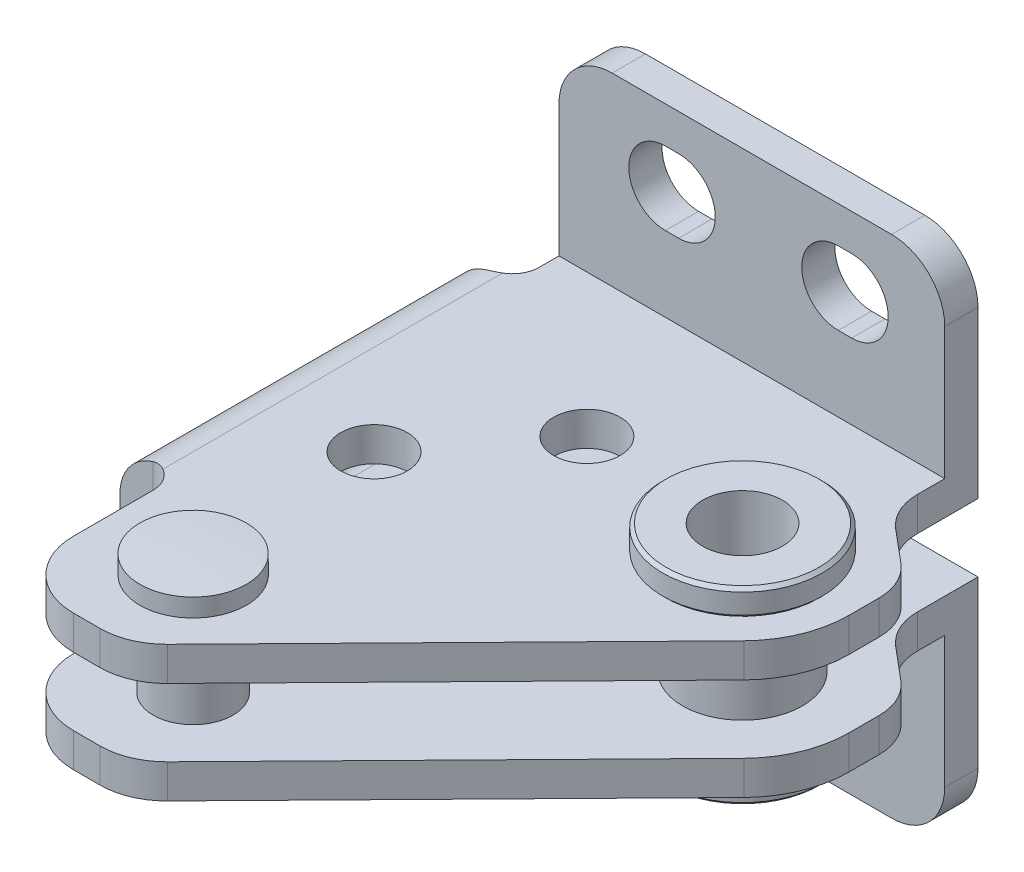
ISO-10303-21;
HEADER;
FILE_DESCRIPTION(('STEP AP214'),'2;1');
FILE_NAME('part.step','',(''),(''),'','','');
FILE_SCHEMA(('AUTOMOTIVE_DESIGN { 1 0 10303 214 1 1 1 1 }'));
ENDSEC;
DATA;
#1=APPLICATION_CONTEXT('core data for automotive mechanical design processes');
#2=APPLICATION_PROTOCOL_DEFINITION('international standard','automotive_design',2000,#1);
#3=PRODUCT_CONTEXT('',#1,'mechanical');
#4=PRODUCT('Part','Part','',(#3));
#5=PRODUCT_RELATED_PRODUCT_CATEGORY('part','',(#4));
#6=PRODUCT_DEFINITION_FORMATION('','',#4);
#7=PRODUCT_DEFINITION_CONTEXT('part definition',#1,'design');
#8=PRODUCT_DEFINITION('design','',#6,#7);
#9=PRODUCT_DEFINITION_SHAPE('','',#8);
#10=(LENGTH_UNIT() NAMED_UNIT(*) SI_UNIT(.MILLI.,.METRE.));
#11=(NAMED_UNIT(*) PLANE_ANGLE_UNIT() SI_UNIT($,.RADIAN.));
#12=(NAMED_UNIT(*) SI_UNIT($,.STERADIAN.) SOLID_ANGLE_UNIT());
#13=UNCERTAINTY_MEASURE_WITH_UNIT(LENGTH_MEASURE(1.E-05),#10,'distance_accuracy_value','');
#14=(GEOMETRIC_REPRESENTATION_CONTEXT(3) GLOBAL_UNCERTAINTY_ASSIGNED_CONTEXT((#13)) GLOBAL_UNIT_ASSIGNED_CONTEXT((#10,
#11,#12)) REPRESENTATION_CONTEXT('',''));
#15=CARTESIAN_POINT('',(0.,0.,0.));
#16=DIRECTION('',(0.,0.,1.));
#17=DIRECTION('',(1.,0.,0.));
#18=AXIS2_PLACEMENT_3D('',#15,#16,#17);
#19=CARTESIAN_POINT('',(-12.5,8.4,6.));
#20=DIRECTION('',(-1.,0.,0.));
#21=DIRECTION('',(0.,-1.,0.));
#22=AXIS2_PLACEMENT_3D('',#19,#20,#21);
#23=PLANE('',#22);
#24=DIRECTION('',(0.,0.,-1.));
#25=VECTOR('',#24,1.);
#26=CARTESIAN_POINT('',(-12.5,11.9,48.5));
#27=LINE('',#26,#25);
#28=CARTESIAN_POINT('',(-12.5,11.9,31.));
#29=VERTEX_POINT('',#28);
#30=CARTESIAN_POINT('',(-12.5,11.9,6.));
#31=VERTEX_POINT('',#30);
#32=EDGE_CURVE('E714',#29,#31,#27,.T.);
#33=ORIENTED_EDGE('',*,*,#32,.F.);
#34=DIRECTION('',(0.,1.,0.));
#35=VECTOR('',#34,1.);
#36=CARTESIAN_POINT('',(-12.5,8.4,31.));
#37=LINE('',#36,#35);
#38=CARTESIAN_POINT('',(-12.5,15.1,31.));
#39=VERTEX_POINT('',#38);
#40=EDGE_CURVE('E1167',#29,#39,#37,.T.);
#41=ORIENTED_EDGE('',*,*,#40,.T.);
#42=DIRECTION('',(0.,0.,-1.));
#43=VECTOR('',#42,1.);
#44=CARTESIAN_POINT('',(-12.5,15.1,48.5));
#45=LINE('',#44,#43);
#46=CARTESIAN_POINT('',(-12.5,15.1,6.));
#47=VERTEX_POINT('',#46);
#48=EDGE_CURVE('E711',#39,#47,#45,.T.);
#49=ORIENTED_EDGE('',*,*,#48,.T.);
#50=DIRECTION('',(0.,1.,0.));
#51=VECTOR('',#50,1.);
#52=CARTESIAN_POINT('',(-12.5,8.4,6.));
#53=LINE('',#52,#51);
#54=EDGE_CURVE('E1173',#31,#47,#53,.T.);
#55=ORIENTED_EDGE('',*,*,#54,.F.);
#56=EDGE_LOOP('',(#33,#41,#49,#55));
#57=FACE_BOUND('',#56,.T.);
#58=ADVANCED_FACE('F14',(#57),#23,.T.);
#59=CARTESIAN_POINT('',(14.,2.75,2.5));
#60=DIRECTION('',(0.,-1.,0.));
#61=DIRECTION('',(1.,0.,0.));
#62=AXIS2_PLACEMENT_3D('',#59,#60,#61);
#63=PLANE('',#62);
#64=DIRECTION('',(-1.,0.,0.));
#65=VECTOR('',#64,1.);
#66=CARTESIAN_POINT('',(14.,2.75,0.));
#67=LINE('',#66,#65);
#68=CARTESIAN_POINT('',(14.,2.75,0.));
#69=VERTEX_POINT('',#68);
#70=CARTESIAN_POINT('',(13.,2.75,0.));
#71=VERTEX_POINT('',#70);
#72=EDGE_CURVE('E632',#69,#71,#67,.T.);
#73=ORIENTED_EDGE('',*,*,#72,.F.);
#74=DIRECTION('',(0.,0.,-1.));
#75=VECTOR('',#74,1.);
#76=CARTESIAN_POINT('',(14.,2.75,2.5));
#77=LINE('',#76,#75);
#78=CARTESIAN_POINT('',(14.,2.75,2.5));
#79=VERTEX_POINT('',#78);
#80=EDGE_CURVE('E657',#79,#69,#77,.T.);
#81=ORIENTED_EDGE('',*,*,#80,.F.);
#82=DIRECTION('',(-1.,0.,0.));
#83=VECTOR('',#82,1.);
#84=CARTESIAN_POINT('',(14.,2.75,2.5));
#85=LINE('',#84,#83);
#86=CARTESIAN_POINT('',(13.,2.75,2.5));
#87=VERTEX_POINT('',#86);
#88=EDGE_CURVE('E646',#79,#87,#85,.T.);
#89=ORIENTED_EDGE('',*,*,#88,.T.);
#90=DIRECTION('',(0.,0.,-1.));
#91=VECTOR('',#90,1.);
#92=CARTESIAN_POINT('',(13.,2.75,2.5));
#93=LINE('',#92,#91);
#94=EDGE_CURVE('E655',#87,#71,#93,.T.);
#95=ORIENTED_EDGE('',*,*,#94,.T.);
#96=EDGE_LOOP('',(#73,#81,#89,#95));
#97=FACE_BOUND('',#96,.T.);
#98=ADVANCED_FACE('F1035',(#97),#63,.T.);
#99=CARTESIAN_POINT('',(14.,0.,2.5));
#100=DIRECTION('',(0.,0.,-1.));
#101=DIRECTION('',(0.,-1.,0.));
#102=AXIS2_PLACEMENT_3D('',#99,#100,#101);
#103=CYLINDRICAL_SURFACE('',#102,2.75);
#104=CARTESIAN_POINT('',(14.,0.,0.));
#105=DIRECTION('',(0.,0.,1.));
#106=DIRECTION('',(-1.,0.,0.));
#107=AXIS2_PLACEMENT_3D('',#104,#105,#106);
#108=CIRCLE('',#107,2.75);
#109=CARTESIAN_POINT('',(14.,-2.75,0.));
#110=VERTEX_POINT('',#109);
#111=EDGE_CURVE('E628',#110,#69,#108,.T.);
#112=ORIENTED_EDGE('',*,*,#111,.F.);
#113=DIRECTION('',(0.,0.,-1.));
#114=VECTOR('',#113,1.);
#115=CARTESIAN_POINT('',(14.,-2.75,2.5));
#116=LINE('',#115,#114);
#117=CARTESIAN_POINT('',(14.,-2.75,2.5));
#118=VERTEX_POINT('',#117);
#119=EDGE_CURVE('E659',#118,#110,#116,.T.);
#120=ORIENTED_EDGE('',*,*,#119,.F.);
#121=CARTESIAN_POINT('',(14.,0.,2.5));
#122=DIRECTION('',(0.,0.,1.));
#123=DIRECTION('',(-1.,0.,0.));
#124=AXIS2_PLACEMENT_3D('',#121,#122,#123);
#125=CIRCLE('',#124,2.75);
#126=EDGE_CURVE('E644',#118,#79,#125,.T.);
#127=ORIENTED_EDGE('',*,*,#126,.T.);
#128=ORIENTED_EDGE('',*,*,#80,.T.);
#129=EDGE_LOOP('',(#112,#120,#127,#128));
#130=FACE_BOUND('',#129,.T.);
#131=ADVANCED_FACE('F1038',(#130),#103,.F.);
#132=CARTESIAN_POINT('',(13.,-2.75,2.5));
#133=DIRECTION('',(0.,1.,0.));
#134=DIRECTION('',(-1.,0.,0.));
#135=AXIS2_PLACEMENT_3D('',#132,#133,#134);
#136=PLANE('',#135);
#137=DIRECTION('',(1.,0.,0.));
#138=VECTOR('',#137,1.);
#139=CARTESIAN_POINT('',(13.,-2.75,0.));
#140=LINE('',#139,#138);
#141=CARTESIAN_POINT('',(13.,-2.75,0.));
#142=VERTEX_POINT('',#141);
#143=EDGE_CURVE('E627',#142,#110,#140,.T.);
#144=ORIENTED_EDGE('',*,*,#143,.F.);
#145=DIRECTION('',(0.,0.,-1.));
#146=VECTOR('',#145,1.);
#147=CARTESIAN_POINT('',(13.,-2.75,2.5));
#148=LINE('',#147,#146);
#149=CARTESIAN_POINT('',(13.,-2.75,2.5));
#150=VERTEX_POINT('',#149);
#151=EDGE_CURVE('E651',#150,#142,#148,.T.);
#152=ORIENTED_EDGE('',*,*,#151,.F.);
#153=DIRECTION('',(1.,0.,0.));
#154=VECTOR('',#153,1.);
#155=CARTESIAN_POINT('',(13.,-2.75,2.5));
#156=LINE('',#155,#154);
#157=EDGE_CURVE('E640',#150,#118,#156,.T.);
#158=ORIENTED_EDGE('',*,*,#157,.T.);
#159=ORIENTED_EDGE('',*,*,#119,.T.);
#160=EDGE_LOOP('',(#144,#152,#158,#159));
#161=FACE_BOUND('',#160,.T.);
#162=ADVANCED_FACE('F1033',(#161),#136,.T.);
#163=CARTESIAN_POINT('',(13.,0.,2.5));
#164=DIRECTION('',(0.,0.,-1.));
#165=DIRECTION('',(0.,-1.,0.));
#166=AXIS2_PLACEMENT_3D('',#163,#164,#165);
#167=CYLINDRICAL_SURFACE('',#166,2.75);
#168=CARTESIAN_POINT('',(13.,0.,0.));
#169=DIRECTION('',(0.,0.,1.));
#170=DIRECTION('',(1.,0.,0.));
#171=AXIS2_PLACEMENT_3D('',#168,#169,#170);
#172=CIRCLE('',#171,2.75);
#173=EDGE_CURVE('E636',#71,#142,#172,.T.);
#174=ORIENTED_EDGE('',*,*,#173,.F.);
#175=ORIENTED_EDGE('',*,*,#94,.F.);
#176=CARTESIAN_POINT('',(13.,0.,2.5));
#177=DIRECTION('',(0.,0.,1.));
#178=DIRECTION('',(1.,0.,0.));
#179=AXIS2_PLACEMENT_3D('',#176,#177,#178);
#180=CIRCLE('',#179,2.75);
#181=EDGE_CURVE('E649',#87,#150,#180,.T.);
#182=ORIENTED_EDGE('',*,*,#181,.T.);
#183=ORIENTED_EDGE('',*,*,#151,.T.);
#184=EDGE_LOOP('',(#174,#175,#182,#183));
#185=FACE_BOUND('',#184,.T.);
#186=ADVANCED_FACE('F1029',(#185),#167,.F.);
#187=CARTESIAN_POINT('',(-3.99999999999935,-1.49999999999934,2.5));
#188=DIRECTION('',(0.,0.,-1.));
#189=DIRECTION('',(0.,-1.,0.));
#190=AXIS2_PLACEMENT_3D('',#187,#188,#189);
#191=CYLINDRICAL_SURFACE('',#190,4.00000000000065);
#192=CARTESIAN_POINT('',(-3.99999999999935,-1.49999999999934,0.));
#193=DIRECTION('',(0.,0.,1.));
#194=DIRECTION('',(-1.,0.,0.));
#195=AXIS2_PLACEMENT_3D('',#192,#193,#194);
#196=CIRCLE('',#195,4.00000000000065);
#197=CARTESIAN_POINT('',(-8.,-1.5,0.));
#198=VERTEX_POINT('',#197);
#199=CARTESIAN_POINT('',(-4.,-5.5,0.));
#200=VERTEX_POINT('',#199);
#201=EDGE_CURVE('E1358',#198,#200,#196,.T.);
#202=ORIENTED_EDGE('',*,*,#201,.T.);
#203=DIRECTION('',(0.,0.,-1.));
#204=VECTOR('',#203,1.);
#205=CARTESIAN_POINT('',(-4.,-5.5,2.5));
#206=LINE('',#205,#204);
#207=CARTESIAN_POINT('',(-4.,-5.5,2.5));
#208=VERTEX_POINT('',#207);
#209=EDGE_CURVE('E1324',#208,#200,#206,.T.);
#210=ORIENTED_EDGE('',*,*,#209,.F.);
#211=CARTESIAN_POINT('',(-3.99999999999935,-1.49999999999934,2.5));
#212=DIRECTION('',(0.,0.,1.));
#213=DIRECTION('',(-1.,0.,0.));
#214=AXIS2_PLACEMENT_3D('',#211,#212,#213);
#215=CIRCLE('',#214,4.00000000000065);
#216=CARTESIAN_POINT('',(-8.,-1.5,2.5));
#217=VERTEX_POINT('',#216);
#218=EDGE_CURVE('E1341',#217,#208,#215,.T.);
#219=ORIENTED_EDGE('',*,*,#218,.F.);
#220=DIRECTION('',(0.,0.,-1.));
#221=VECTOR('',#220,1.);
#222=CARTESIAN_POINT('',(-8.,-1.5,2.5));
#223=LINE('',#222,#221);
#224=EDGE_CURVE('E1321',#217,#198,#223,.T.);
#225=ORIENTED_EDGE('',*,*,#224,.T.);
#226=EDGE_LOOP('',(#202,#210,#219,#225));
#227=FACE_BOUND('',#226,.T.);
#228=ADVANCED_FACE('F1032',(#227),#191,.T.);
#229=CARTESIAN_POINT('',(-4.,-5.5,2.5));
#230=DIRECTION('',(0.,1.,0.));
#231=DIRECTION('',(-1.,0.,0.));
#232=AXIS2_PLACEMENT_3D('',#229,#230,#231);
#233=PLANE('',#232);
#234=DIRECTION('',(1.,0.,0.));
#235=VECTOR('',#234,1.);
#236=CARTESIAN_POINT('',(-4.,-5.5,0.));
#237=LINE('',#236,#235);
#238=CARTESIAN_POINT('',(17.,-5.5,0.));
#239=VERTEX_POINT('',#238);
#240=EDGE_CURVE('E1355',#200,#239,#237,.T.);
#241=ORIENTED_EDGE('',*,*,#240,.T.);
#242=DIRECTION('',(0.,0.,-1.));
#243=VECTOR('',#242,1.);
#244=CARTESIAN_POINT('',(17.,-5.5,2.5));
#245=LINE('',#244,#243);
#246=CARTESIAN_POINT('',(17.,-5.5,2.5));
#247=VERTEX_POINT('',#246);
#248=EDGE_CURVE('E1327',#247,#239,#245,.T.);
#249=ORIENTED_EDGE('',*,*,#248,.F.);
#250=DIRECTION('',(1.,0.,0.));
#251=VECTOR('',#250,1.);
#252=CARTESIAN_POINT('',(-4.,-5.5,2.5));
#253=LINE('',#252,#251);
#254=EDGE_CURVE('E1339',#208,#247,#253,.T.);
#255=ORIENTED_EDGE('',*,*,#254,.F.);
#256=ORIENTED_EDGE('',*,*,#209,.T.);
#257=EDGE_LOOP('',(#241,#249,#255,#256));
#258=FACE_BOUND('',#257,.T.);
#259=ADVANCED_FACE('F1056',(#258),#233,.F.);
#260=CARTESIAN_POINT('',(1.,2.75,2.5));
#261=DIRECTION('',(0.,-1.,0.));
#262=DIRECTION('',(1.,0.,0.));
#263=AXIS2_PLACEMENT_3D('',#260,#261,#262);
#264=PLANE('',#263);
#265=DIRECTION('',(-1.,0.,0.));
#266=VECTOR('',#265,1.);
#267=CARTESIAN_POINT('',(1.,2.75,0.));
#268=LINE('',#267,#266);
#269=CARTESIAN_POINT('',(1.,2.75,0.));
#270=VERTEX_POINT('',#269);
#271=CARTESIAN_POINT('',(0.,2.75,0.));
#272=VERTEX_POINT('',#271);
#273=EDGE_CURVE('E667',#270,#272,#268,.T.);
#274=ORIENTED_EDGE('',*,*,#273,.F.);
#275=DIRECTION('',(0.,0.,-1.));
#276=VECTOR('',#275,1.);
#277=CARTESIAN_POINT('',(1.,2.75,2.5));
#278=LINE('',#277,#276);
#279=CARTESIAN_POINT('',(1.,2.75,2.5));
#280=VERTEX_POINT('',#279);
#281=EDGE_CURVE('E692',#280,#270,#278,.T.);
#282=ORIENTED_EDGE('',*,*,#281,.F.);
#283=DIRECTION('',(-1.,0.,0.));
#284=VECTOR('',#283,1.);
#285=CARTESIAN_POINT('',(1.,2.75,2.5));
#286=LINE('',#285,#284);
#287=CARTESIAN_POINT('',(0.,2.75,2.5));
#288=VERTEX_POINT('',#287);
#289=EDGE_CURVE('E681',#280,#288,#286,.T.);
#290=ORIENTED_EDGE('',*,*,#289,.T.);
#291=DIRECTION('',(0.,0.,-1.));
#292=VECTOR('',#291,1.);
#293=CARTESIAN_POINT('',(0.,2.75,2.5));
#294=LINE('',#293,#292);
#295=EDGE_CURVE('E690',#288,#272,#294,.T.);
#296=ORIENTED_EDGE('',*,*,#295,.T.);
#297=EDGE_LOOP('',(#274,#282,#290,#296));
#298=FACE_BOUND('',#297,.T.);
#299=ADVANCED_FACE('F1052',(#298),#264,.T.);
#300=CARTESIAN_POINT('',(1.,0.,2.5));
#301=DIRECTION('',(0.,0.,-1.));
#302=DIRECTION('',(0.,-1.,0.));
#303=AXIS2_PLACEMENT_3D('',#300,#301,#302);
#304=CYLINDRICAL_SURFACE('',#303,2.75);
#305=CARTESIAN_POINT('',(1.,0.,0.));
#306=DIRECTION('',(0.,0.,1.));
#307=DIRECTION('',(-1.,0.,0.));
#308=AXIS2_PLACEMENT_3D('',#305,#306,#307);
#309=CIRCLE('',#308,2.75);
#310=CARTESIAN_POINT('',(1.,-2.75,0.));
#311=VERTEX_POINT('',#310);
#312=EDGE_CURVE('E663',#311,#270,#309,.T.);
#313=ORIENTED_EDGE('',*,*,#312,.F.);
#314=DIRECTION('',(0.,0.,-1.));
#315=VECTOR('',#314,1.);
#316=CARTESIAN_POINT('',(1.,-2.75,2.5));
#317=LINE('',#316,#315);
#318=CARTESIAN_POINT('',(1.,-2.75,2.5));
#319=VERTEX_POINT('',#318);
#320=EDGE_CURVE('E694',#319,#311,#317,.T.);
#321=ORIENTED_EDGE('',*,*,#320,.F.);
#322=CARTESIAN_POINT('',(1.,0.,2.5));
#323=DIRECTION('',(0.,0.,1.));
#324=DIRECTION('',(-1.,0.,0.));
#325=AXIS2_PLACEMENT_3D('',#322,#323,#324);
#326=CIRCLE('',#325,2.75);
#327=EDGE_CURVE('E679',#319,#280,#326,.T.);
#328=ORIENTED_EDGE('',*,*,#327,.T.);
#329=ORIENTED_EDGE('',*,*,#281,.T.);
#330=EDGE_LOOP('',(#313,#321,#328,#329));
#331=FACE_BOUND('',#330,.T.);
#332=ADVANCED_FACE('F1055',(#331),#304,.F.);
#333=CARTESIAN_POINT('',(0.,-2.75,2.5));
#334=DIRECTION('',(0.,1.,0.));
#335=DIRECTION('',(-1.,0.,0.));
#336=AXIS2_PLACEMENT_3D('',#333,#334,#335);
#337=PLANE('',#336);
#338=DIRECTION('',(1.,0.,0.));
#339=VECTOR('',#338,1.);
#340=CARTESIAN_POINT('',(0.,-2.75,0.));
#341=LINE('',#340,#339);
#342=CARTESIAN_POINT('',(0.,-2.75,0.));
#343=VERTEX_POINT('',#342);
#344=EDGE_CURVE('E662',#343,#311,#341,.T.);
#345=ORIENTED_EDGE('',*,*,#344,.F.);
#346=DIRECTION('',(0.,0.,-1.));
#347=VECTOR('',#346,1.);
#348=CARTESIAN_POINT('',(0.,-2.75,2.5));
#349=LINE('',#348,#347);
#350=CARTESIAN_POINT('',(0.,-2.75,2.5));
#351=VERTEX_POINT('',#350);
#352=EDGE_CURVE('E686',#351,#343,#349,.T.);
#353=ORIENTED_EDGE('',*,*,#352,.F.);
#354=DIRECTION('',(1.,0.,0.));
#355=VECTOR('',#354,1.);
#356=CARTESIAN_POINT('',(0.,-2.75,2.5));
#357=LINE('',#356,#355);
#358=EDGE_CURVE('E675',#351,#319,#357,.T.);
#359=ORIENTED_EDGE('',*,*,#358,.T.);
#360=ORIENTED_EDGE('',*,*,#320,.T.);
#361=EDGE_LOOP('',(#345,#353,#359,#360));
#362=FACE_BOUND('',#361,.T.);
#363=ADVANCED_FACE('F1050',(#362),#337,.T.);
#364=CARTESIAN_POINT('',(0.,0.,2.5));
#365=DIRECTION('',(0.,0.,-1.));
#366=DIRECTION('',(0.,-1.,0.));
#367=AXIS2_PLACEMENT_3D('',#364,#365,#366);
#368=CYLINDRICAL_SURFACE('',#367,2.75);
#369=CARTESIAN_POINT('',(0.,0.,0.));
#370=DIRECTION('',(0.,0.,1.));
#371=DIRECTION('',(1.,0.,0.));
#372=AXIS2_PLACEMENT_3D('',#369,#370,#371);
#373=CIRCLE('',#372,2.75);
#374=EDGE_CURVE('E671',#272,#343,#373,.T.);
#375=ORIENTED_EDGE('',*,*,#374,.F.);
#376=ORIENTED_EDGE('',*,*,#295,.F.);
#377=CARTESIAN_POINT('',(0.,0.,2.5));
#378=DIRECTION('',(0.,0.,1.));
#379=DIRECTION('',(1.,0.,0.));
#380=AXIS2_PLACEMENT_3D('',#377,#378,#379);
#381=CIRCLE('',#380,2.75);
#382=EDGE_CURVE('E684',#288,#351,#381,.T.);
#383=ORIENTED_EDGE('',*,*,#382,.T.);
#384=ORIENTED_EDGE('',*,*,#352,.T.);
#385=EDGE_LOOP('',(#375,#376,#383,#384));
#386=FACE_BOUND('',#385,.T.);
#387=ADVANCED_FACE('F1046',(#386),#368,.F.);
#388=CARTESIAN_POINT('',(16.9999999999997,-1.4999999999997,2.5));
#389=DIRECTION('',(0.,0.,-1.));
#390=DIRECTION('',(0.,-1.,0.));
#391=AXIS2_PLACEMENT_3D('',#388,#389,#390);
#392=CYLINDRICAL_SURFACE('',#391,4.00000000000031);
#393=CARTESIAN_POINT('',(16.9999999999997,-1.4999999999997,0.));
#394=DIRECTION('',(0.,0.,1.));
#395=DIRECTION('',(-1.,0.,0.));
#396=AXIS2_PLACEMENT_3D('',#393,#394,#395);
#397=CIRCLE('',#396,4.00000000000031);
#398=CARTESIAN_POINT('',(21.,-1.5,0.));
#399=VERTEX_POINT('',#398);
#400=EDGE_CURVE('E1351',#239,#399,#397,.T.);
#401=ORIENTED_EDGE('',*,*,#400,.T.);
#402=DIRECTION('',(0.,0.,-1.));
#403=VECTOR('',#402,1.);
#404=CARTESIAN_POINT('',(21.,-1.5,2.5));
#405=LINE('',#404,#403);
#406=CARTESIAN_POINT('',(21.,-1.5,2.5));
#407=VERTEX_POINT('',#406);
#408=EDGE_CURVE('E1330',#407,#399,#405,.T.);
#409=ORIENTED_EDGE('',*,*,#408,.F.);
#410=CARTESIAN_POINT('',(16.9999999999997,-1.4999999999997,2.5));
#411=DIRECTION('',(0.,0.,1.));
#412=DIRECTION('',(-1.,0.,0.));
#413=AXIS2_PLACEMENT_3D('',#410,#411,#412);
#414=CIRCLE('',#413,4.00000000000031);
#415=EDGE_CURVE('E1333',#247,#407,#414,.T.);
#416=ORIENTED_EDGE('',*,*,#415,.F.);
#417=ORIENTED_EDGE('',*,*,#248,.T.);
#418=EDGE_LOOP('',(#401,#409,#416,#417));
#419=FACE_BOUND('',#418,.T.);
#420=ADVANCED_FACE('F1049',(#419),#392,.T.);
#421=CARTESIAN_POINT('',(-10.,8.4,6.));
#422=DIRECTION('',(0.,0.,-1.));
#423=DIRECTION('',(0.,-1.,0.));
#424=AXIS2_PLACEMENT_3D('',#421,#422,#423);
#425=PLANE('',#424);
#426=DIRECTION('',(0.,1.,0.));
#427=VECTOR('',#426,1.);
#428=CARTESIAN_POINT('',(-10.,8.4,6.));
#429=LINE('',#428,#427);
#430=CARTESIAN_POINT('',(-10.,8.54589803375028,6.));
#431=VERTEX_POINT('',#430);
#432=CARTESIAN_POINT('',(-10.,11.9,6.));
#433=VERTEX_POINT('',#432);
#434=EDGE_CURVE('E1140',#431,#433,#429,.T.);
#435=ORIENTED_EDGE('',*,*,#434,.F.);
#436=CARTESIAN_POINT('',(-9.,11.8999999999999,6.));
#437=DIRECTION('',(0.,0.,-1.));
#438=DIRECTION('',(0.,-1.,0.));
#439=AXIS2_PLACEMENT_3D('',#436,#437,#438);
#440=CIRCLE('',#439,3.49999999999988);
#441=EDGE_CURVE('E1121',#431,#31,#440,.T.);
#442=ORIENTED_EDGE('',*,*,#441,.T.);
#443=ORIENTED_EDGE('',*,*,#54,.T.);
#444=CARTESIAN_POINT('',(-9.,15.1,6.));
#445=DIRECTION('',(0.,0.,-1.));
#446=DIRECTION('',(0.,-1.,0.));
#447=AXIS2_PLACEMENT_3D('',#444,#445,#446);
#448=CIRCLE('',#447,3.49999999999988);
#449=CARTESIAN_POINT('',(-10.,18.4541019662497,6.));
#450=VERTEX_POINT('',#449);
#451=EDGE_CURVE('E731',#47,#450,#448,.T.);
#452=ORIENTED_EDGE('',*,*,#451,.T.);
#453=CARTESIAN_POINT('',(-10.,15.1,6.));
#454=VERTEX_POINT('',#453);
#455=EDGE_CURVE('E1143',#454,#450,#429,.T.);
#456=ORIENTED_EDGE('',*,*,#455,.F.);
#457=DIRECTION('',(0.,-1.,0.));
#458=VECTOR('',#457,1.);
#459=CARTESIAN_POINT('',(-10.,8.4,6.));
#460=LINE('',#459,#458);
#461=EDGE_CURVE('E795',#454,#433,#460,.T.);
#462=ORIENTED_EDGE('',*,*,#461,.T.);
#463=EDGE_LOOP('',(#435,#442,#443,#452,#456,#462));
#464=FACE_BOUND('',#463,.T.);
#465=ADVANCED_FACE('F769',(#464),#425,.T.);
#466=CARTESIAN_POINT('',(-10.,15.1,46.));
#467=DIRECTION('',(1.,0.,0.));
#468=DIRECTION('',(0.,1.,0.));
#469=AXIS2_PLACEMENT_3D('',#466,#467,#468);
#470=PLANE('',#469);
#471=DIRECTION('',(0.,0.,-1.));
#472=VECTOR('',#471,1.);
#473=CARTESIAN_POINT('',(-10.,15.1,46.));
#474=LINE('',#473,#472);
#475=CARTESIAN_POINT('',(-10.,15.1,31.));
#476=VERTEX_POINT('',#475);
#477=EDGE_CURVE('E1118',#476,#454,#474,.T.);
#478=ORIENTED_EDGE('',*,*,#477,.F.);
#479=DIRECTION('',(0.,1.,0.));
#480=VECTOR('',#479,1.);
#481=CARTESIAN_POINT('',(-10.,8.4,31.));
#482=LINE('',#481,#480);
#483=CARTESIAN_POINT('',(-10.,11.9,31.));
#484=VERTEX_POINT('',#483);
#485=EDGE_CURVE('E1159',#484,#476,#482,.T.);
#486=ORIENTED_EDGE('',*,*,#485,.F.);
#487=DIRECTION('',(0.,0.,-1.));
#488=VECTOR('',#487,1.);
#489=CARTESIAN_POINT('',(-10.,11.9,46.));
#490=LINE('',#489,#488);
#491=EDGE_CURVE('E1115',#484,#433,#490,.T.);
#492=ORIENTED_EDGE('',*,*,#491,.T.);
#493=ORIENTED_EDGE('',*,*,#461,.F.);
#494=EDGE_LOOP('',(#478,#486,#492,#493));
#495=FACE_BOUND('',#494,.T.);
#496=ADVANCED_FACE('F802',(#495),#470,.T.);
#497=CARTESIAN_POINT('',(-12.5,8.4,31.));
#498=DIRECTION('',(0.,0.,1.));
#499=DIRECTION('',(0.,1.,0.));
#500=AXIS2_PLACEMENT_3D('',#497,#498,#499);
#501=PLANE('',#500);
#502=ORIENTED_EDGE('',*,*,#40,.F.);
#503=CARTESIAN_POINT('',(-9.,11.8999999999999,31.));
#504=DIRECTION('',(0.,0.,1.));
#505=DIRECTION('',(0.,1.,0.));
#506=AXIS2_PLACEMENT_3D('',#503,#504,#505);
#507=CIRCLE('',#506,3.49999999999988);
#508=CARTESIAN_POINT('',(-10.,8.54589803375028,31.));
#509=VERTEX_POINT('',#508);
#510=EDGE_CURVE('E759',#29,#509,#507,.T.);
#511=ORIENTED_EDGE('',*,*,#510,.T.);
#512=EDGE_CURVE('E1162',#509,#484,#482,.T.);
#513=ORIENTED_EDGE('',*,*,#512,.T.);
#514=ORIENTED_EDGE('',*,*,#485,.T.);
#515=CARTESIAN_POINT('',(-10.,18.4541019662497,31.));
#516=VERTEX_POINT('',#515);
#517=EDGE_CURVE('E1156',#476,#516,#482,.T.);
#518=ORIENTED_EDGE('',*,*,#517,.T.);
#519=CARTESIAN_POINT('',(-9.,15.1,31.));
#520=DIRECTION('',(0.,0.,1.));
#521=DIRECTION('',(0.,1.,0.));
#522=AXIS2_PLACEMENT_3D('',#519,#520,#521);
#523=CIRCLE('',#522,3.49999999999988);
#524=EDGE_CURVE('E719',#516,#39,#523,.T.);
#525=ORIENTED_EDGE('',*,*,#524,.T.);
#526=EDGE_LOOP('',(#502,#511,#513,#514,#518,#525));
#527=FACE_BOUND('',#526,.T.);
#528=ADVANCED_FACE('F1164',(#527),#501,.T.);
#529=CARTESIAN_POINT('',(14.,29.75,2.5));
#530=DIRECTION('',(0.,-1.,0.));
#531=DIRECTION('',(1.,0.,0.));
#532=AXIS2_PLACEMENT_3D('',#529,#530,#531);
#533=PLANE('',#532);
#534=DIRECTION('',(-1.,0.,0.));
#535=VECTOR('',#534,1.);
#536=CARTESIAN_POINT('',(14.,29.75,0.));
#537=LINE('',#536,#535);
#538=CARTESIAN_POINT('',(14.,29.75,0.));
#539=VERTEX_POINT('',#538);
#540=CARTESIAN_POINT('',(13.,29.75,0.));
#541=VERTEX_POINT('',#540);
#542=EDGE_CURVE('E564',#539,#541,#537,.T.);
#543=ORIENTED_EDGE('',*,*,#542,.F.);
#544=DIRECTION('',(0.,0.,-1.));
#545=VECTOR('',#544,1.);
#546=CARTESIAN_POINT('',(14.,29.75,2.5));
#547=LINE('',#546,#545);
#548=CARTESIAN_POINT('',(14.,29.75,2.5));
#549=VERTEX_POINT('',#548);
#550=EDGE_CURVE('E588',#549,#539,#547,.T.);
#551=ORIENTED_EDGE('',*,*,#550,.F.);
#552=DIRECTION('',(-1.,0.,0.));
#553=VECTOR('',#552,1.);
#554=CARTESIAN_POINT('',(14.,29.75,2.5));
#555=LINE('',#554,#553);
#556=CARTESIAN_POINT('',(13.,29.75,2.5));
#557=VERTEX_POINT('',#556);
#558=EDGE_CURVE('E578',#549,#557,#555,.T.);
#559=ORIENTED_EDGE('',*,*,#558,.T.);
#560=DIRECTION('',(0.,0.,-1.));
#561=VECTOR('',#560,1.);
#562=CARTESIAN_POINT('',(13.,29.75,2.5));
#563=LINE('',#562,#561);
#564=EDGE_CURVE('E586',#557,#541,#563,.T.);
#565=ORIENTED_EDGE('',*,*,#564,.T.);
#566=EDGE_LOOP('',(#543,#551,#559,#565));
#567=FACE_BOUND('',#566,.T.);
#568=ADVANCED_FACE('F1650',(#567),#533,.T.);
#569=CARTESIAN_POINT('',(14.,27.,2.5));
#570=DIRECTION('',(0.,0.,-1.));
#571=DIRECTION('',(0.,-1.,0.));
#572=AXIS2_PLACEMENT_3D('',#569,#570,#571);
#573=CYLINDRICAL_SURFACE('',#572,2.75);
#574=CARTESIAN_POINT('',(14.,27.,0.));
#575=DIRECTION('',(0.,0.,1.));
#576=DIRECTION('',(-1.,0.,0.));
#577=AXIS2_PLACEMENT_3D('',#574,#575,#576);
#578=CIRCLE('',#577,2.75);
#579=CARTESIAN_POINT('',(14.,24.25,0.));
#580=VERTEX_POINT('',#579);
#581=EDGE_CURVE('E560',#580,#539,#578,.T.);
#582=ORIENTED_EDGE('',*,*,#581,.F.);
#583=DIRECTION('',(0.,0.,-1.));
#584=VECTOR('',#583,1.);
#585=CARTESIAN_POINT('',(14.,24.25,2.5));
#586=LINE('',#585,#584);
#587=CARTESIAN_POINT('',(14.,24.25,2.5));
#588=VERTEX_POINT('',#587);
#589=EDGE_CURVE('E590',#588,#580,#586,.T.);
#590=ORIENTED_EDGE('',*,*,#589,.F.);
#591=CARTESIAN_POINT('',(14.,27.,2.5));
#592=DIRECTION('',(0.,0.,1.));
#593=DIRECTION('',(-1.,0.,0.));
#594=AXIS2_PLACEMENT_3D('',#591,#592,#593);
#595=CIRCLE('',#594,2.75);
#596=EDGE_CURVE('E576',#588,#549,#595,.T.);
#597=ORIENTED_EDGE('',*,*,#596,.T.);
#598=ORIENTED_EDGE('',*,*,#550,.T.);
#599=EDGE_LOOP('',(#582,#590,#597,#598));
#600=FACE_BOUND('',#599,.T.);
#601=ADVANCED_FACE('F1643',(#600),#573,.F.);
#602=CARTESIAN_POINT('',(13.,24.25,2.5));
#603=DIRECTION('',(0.,1.,0.));
#604=DIRECTION('',(-1.,0.,0.));
#605=AXIS2_PLACEMENT_3D('',#602,#603,#604);
#606=PLANE('',#605);
#607=DIRECTION('',(1.,0.,0.));
#608=VECTOR('',#607,1.);
#609=CARTESIAN_POINT('',(13.,24.25,0.));
#610=LINE('',#609,#608);
#611=CARTESIAN_POINT('',(13.,24.25,0.));
#612=VERTEX_POINT('',#611);
#613=EDGE_CURVE('E30',#612,#580,#610,.T.);
#614=ORIENTED_EDGE('',*,*,#613,.F.);
#615=DIRECTION('',(0.,0.,-1.));
#616=VECTOR('',#615,1.);
#617=CARTESIAN_POINT('',(13.,24.25,2.5));
#618=LINE('',#617,#616);
#619=CARTESIAN_POINT('',(13.,24.25,2.5));
#620=VERTEX_POINT('',#619);
#621=EDGE_CURVE('E583',#620,#612,#618,.T.);
#622=ORIENTED_EDGE('',*,*,#621,.F.);
#623=DIRECTION('',(1.,0.,0.));
#624=VECTOR('',#623,1.);
#625=CARTESIAN_POINT('',(13.,24.25,2.5));
#626=LINE('',#625,#624);
#627=EDGE_CURVE('E572',#620,#588,#626,.T.);
#628=ORIENTED_EDGE('',*,*,#627,.T.);
#629=ORIENTED_EDGE('',*,*,#589,.T.);
#630=EDGE_LOOP('',(#614,#622,#628,#629));
#631=FACE_BOUND('',#630,.T.);
#632=ADVANCED_FACE('F1634',(#631),#606,.T.);
#633=CARTESIAN_POINT('',(13.,27.,2.5));
#634=DIRECTION('',(0.,0.,-1.));
#635=DIRECTION('',(0.,-1.,0.));
#636=AXIS2_PLACEMENT_3D('',#633,#634,#635);
#637=CYLINDRICAL_SURFACE('',#636,2.75);
#638=CARTESIAN_POINT('',(13.,27.,0.));
#639=DIRECTION('',(0.,0.,1.));
#640=DIRECTION('',(1.,0.,0.));
#641=AXIS2_PLACEMENT_3D('',#638,#639,#640);
#642=CIRCLE('',#641,2.75);
#643=EDGE_CURVE('E568',#541,#612,#642,.T.);
#644=ORIENTED_EDGE('',*,*,#643,.F.);
#645=ORIENTED_EDGE('',*,*,#564,.F.);
#646=CARTESIAN_POINT('',(13.,27.,2.5));
#647=DIRECTION('',(0.,0.,1.));
#648=DIRECTION('',(1.,0.,0.));
#649=AXIS2_PLACEMENT_3D('',#646,#647,#648);
#650=CIRCLE('',#649,2.75);
#651=EDGE_CURVE('E581',#557,#620,#650,.T.);
#652=ORIENTED_EDGE('',*,*,#651,.T.);
#653=ORIENTED_EDGE('',*,*,#621,.T.);
#654=EDGE_LOOP('',(#644,#645,#652,#653));
#655=FACE_BOUND('',#654,.T.);
#656=ADVANCED_FACE('F1519',(#655),#637,.F.);
#657=CARTESIAN_POINT('',(16.9999999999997,28.5,2.5));
#658=DIRECTION('',(0.,0.,-1.));
#659=DIRECTION('',(0.,-1.,0.));
#660=AXIS2_PLACEMENT_3D('',#657,#658,#659);
#661=CYLINDRICAL_SURFACE('',#660,4.00000000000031);
#662=CARTESIAN_POINT('',(16.9999999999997,28.5,0.));
#663=DIRECTION('',(0.,0.,1.));
#664=DIRECTION('',(-1.,0.,0.));
#665=AXIS2_PLACEMENT_3D('',#662,#663,#664);
#666=CIRCLE('',#665,4.00000000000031);
#667=CARTESIAN_POINT('',(21.,28.5,0.));
#668=VERTEX_POINT('',#667);
#669=CARTESIAN_POINT('',(17.,32.5,0.));
#670=VERTEX_POINT('',#669);
#671=EDGE_CURVE('E794',#668,#670,#666,.T.);
#672=ORIENTED_EDGE('',*,*,#671,.T.);
#673=DIRECTION('',(0.,0.,-1.));
#674=VECTOR('',#673,1.);
#675=CARTESIAN_POINT('',(17.,32.5,2.5));
#676=LINE('',#675,#674);
#677=CARTESIAN_POINT('',(17.,32.5,2.5));
#678=VERTEX_POINT('',#677);
#679=EDGE_CURVE('E1314',#678,#670,#676,.T.);
#680=ORIENTED_EDGE('',*,*,#679,.F.);
#681=CARTESIAN_POINT('',(16.9999999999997,28.5,2.5));
#682=DIRECTION('',(0.,0.,1.));
#683=DIRECTION('',(-1.,0.,0.));
#684=AXIS2_PLACEMENT_3D('',#681,#682,#683);
#685=CIRCLE('',#684,4.00000000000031);
#686=CARTESIAN_POINT('',(21.,28.5,2.5));
#687=VERTEX_POINT('',#686);
#688=EDGE_CURVE('E1336',#687,#678,#685,.T.);
#689=ORIENTED_EDGE('',*,*,#688,.F.);
#690=DIRECTION('',(0.,0.,-1.));
#691=VECTOR('',#690,1.);
#692=CARTESIAN_POINT('',(21.,28.5,2.5));
#693=LINE('',#692,#691);
#694=EDGE_CURVE('E1311',#687,#668,#693,.T.);
#695=ORIENTED_EDGE('',*,*,#694,.T.);
#696=EDGE_LOOP('',(#672,#680,#689,#695));
#697=FACE_BOUND('',#696,.T.);
#698=ADVANCED_FACE('F1374',(#697),#661,.T.);
#699=CARTESIAN_POINT('',(17.,32.5,2.5));
#700=DIRECTION('',(0.,-1.,0.));
#701=DIRECTION('',(1.,0.,0.));
#702=AXIS2_PLACEMENT_3D('',#699,#700,#701);
#703=PLANE('',#702);
#704=DIRECTION('',(-1.,0.,0.));
#705=VECTOR('',#704,1.);
#706=CARTESIAN_POINT('',(17.,32.5,0.));
#707=LINE('',#706,#705);
#708=CARTESIAN_POINT('',(-4.,32.5,0.));
#709=VERTEX_POINT('',#708);
#710=EDGE_CURVE('E1363',#670,#709,#707,.T.);
#711=ORIENTED_EDGE('',*,*,#710,.T.);
#712=DIRECTION('',(0.,0.,-1.));
#713=VECTOR('',#712,1.);
#714=CARTESIAN_POINT('',(-4.,32.5,2.5));
#715=LINE('',#714,#713);
#716=CARTESIAN_POINT('',(-4.,32.5,2.5));
#717=VERTEX_POINT('',#716);
#718=EDGE_CURVE('E1317',#717,#709,#715,.T.);
#719=ORIENTED_EDGE('',*,*,#718,.F.);
#720=DIRECTION('',(-1.,0.,0.));
#721=VECTOR('',#720,1.);
#722=CARTESIAN_POINT('',(17.,32.5,2.5));
#723=LINE('',#722,#721);
#724=EDGE_CURVE('E1348',#678,#717,#723,.T.);
#725=ORIENTED_EDGE('',*,*,#724,.F.);
#726=ORIENTED_EDGE('',*,*,#679,.T.);
#727=EDGE_LOOP('',(#711,#719,#725,#726));
#728=FACE_BOUND('',#727,.T.);
#729=ADVANCED_FACE('F1021',(#728),#703,.F.);
#730=CARTESIAN_POINT('',(-3.99999999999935,28.4999999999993,2.5));
#731=DIRECTION('',(0.,0.,-1.));
#732=DIRECTION('',(0.,-1.,0.));
#733=AXIS2_PLACEMENT_3D('',#730,#731,#732);
#734=CYLINDRICAL_SURFACE('',#733,4.00000000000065);
#735=CARTESIAN_POINT('',(-3.99999999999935,28.4999999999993,0.));
#736=DIRECTION('',(0.,0.,1.));
#737=DIRECTION('',(1.,0.,0.));
#738=AXIS2_PLACEMENT_3D('',#735,#736,#737);
#739=CIRCLE('',#738,4.00000000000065);
#740=CARTESIAN_POINT('',(-8.,28.4999999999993,0.));
#741=VERTEX_POINT('',#740);
#742=EDGE_CURVE('E1361',#709,#741,#739,.T.);
#743=ORIENTED_EDGE('',*,*,#742,.T.);
#744=DIRECTION('',(0.,0.,-1.));
#745=VECTOR('',#744,1.);
#746=CARTESIAN_POINT('',(-8.,28.4999999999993,2.5));
#747=LINE('',#746,#745);
#748=CARTESIAN_POINT('',(-8.,28.4999999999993,2.5));
#749=VERTEX_POINT('',#748);
#750=EDGE_CURVE('E422',#749,#741,#747,.T.);
#751=ORIENTED_EDGE('',*,*,#750,.F.);
#752=CARTESIAN_POINT('',(-3.99999999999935,28.4999999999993,2.5));
#753=DIRECTION('',(0.,0.,1.));
#754=DIRECTION('',(1.,0.,0.));
#755=AXIS2_PLACEMENT_3D('',#752,#753,#754);
#756=CIRCLE('',#755,4.00000000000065);
#757=EDGE_CURVE('E1346',#717,#749,#756,.T.);
#758=ORIENTED_EDGE('',*,*,#757,.F.);
#759=ORIENTED_EDGE('',*,*,#718,.T.);
#760=EDGE_LOOP('',(#743,#751,#758,#759));
#761=FACE_BOUND('',#760,.T.);
#762=ADVANCED_FACE('F1013',(#761),#734,.T.);
#763=CARTESIAN_POINT('',(1.,29.75,2.5));
#764=DIRECTION('',(0.,-1.,0.));
#765=DIRECTION('',(1.,0.,0.));
#766=AXIS2_PLACEMENT_3D('',#763,#764,#765);
#767=PLANE('',#766);
#768=DIRECTION('',(-1.,0.,0.));
#769=VECTOR('',#768,1.);
#770=CARTESIAN_POINT('',(1.,29.75,0.));
#771=LINE('',#770,#769);
#772=CARTESIAN_POINT('',(1.,29.75,0.));
#773=VERTEX_POINT('',#772);
#774=CARTESIAN_POINT('',(0.,29.75,0.));
#775=VERTEX_POINT('',#774);
#776=EDGE_CURVE('E597',#773,#775,#771,.T.);
#777=ORIENTED_EDGE('',*,*,#776,.F.);
#778=DIRECTION('',(0.,0.,-1.));
#779=VECTOR('',#778,1.);
#780=CARTESIAN_POINT('',(1.,29.75,2.5));
#781=LINE('',#780,#779);
#782=CARTESIAN_POINT('',(1.,29.75,2.5));
#783=VERTEX_POINT('',#782);
#784=EDGE_CURVE('E622',#783,#773,#781,.T.);
#785=ORIENTED_EDGE('',*,*,#784,.F.);
#786=DIRECTION('',(-1.,0.,0.));
#787=VECTOR('',#786,1.);
#788=CARTESIAN_POINT('',(1.,29.75,2.5));
#789=LINE('',#788,#787);
#790=CARTESIAN_POINT('',(0.,29.75,2.5));
#791=VERTEX_POINT('',#790);
#792=EDGE_CURVE('E611',#783,#791,#789,.T.);
#793=ORIENTED_EDGE('',*,*,#792,.T.);
#794=DIRECTION('',(0.,0.,-1.));
#795=VECTOR('',#794,1.);
#796=CARTESIAN_POINT('',(0.,29.75,2.5));
#797=LINE('',#796,#795);
#798=EDGE_CURVE('E620',#791,#775,#797,.T.);
#799=ORIENTED_EDGE('',*,*,#798,.T.);
#800=EDGE_LOOP('',(#777,#785,#793,#799));
#801=FACE_BOUND('',#800,.T.);
#802=ADVANCED_FACE('F1011',(#801),#767,.T.);
#803=CARTESIAN_POINT('',(1.,27.,2.5));
#804=DIRECTION('',(0.,0.,-1.));
#805=DIRECTION('',(0.,-1.,0.));
#806=AXIS2_PLACEMENT_3D('',#803,#804,#805);
#807=CYLINDRICAL_SURFACE('',#806,2.75);
#808=CARTESIAN_POINT('',(1.,27.,0.));
#809=DIRECTION('',(0.,0.,1.));
#810=DIRECTION('',(-1.,0.,0.));
#811=AXIS2_PLACEMENT_3D('',#808,#809,#810);
#812=CIRCLE('',#811,2.75);
#813=CARTESIAN_POINT('',(1.,24.25,0.));
#814=VERTEX_POINT('',#813);
#815=EDGE_CURVE('E593',#814,#773,#812,.T.);
#816=ORIENTED_EDGE('',*,*,#815,.F.);
#817=DIRECTION('',(0.,0.,-1.));
#818=VECTOR('',#817,1.);
#819=CARTESIAN_POINT('',(1.,24.25,2.5));
#820=LINE('',#819,#818);
#821=CARTESIAN_POINT('',(1.,24.25,2.5));
#822=VERTEX_POINT('',#821);
#823=EDGE_CURVE('E624',#822,#814,#820,.T.);
#824=ORIENTED_EDGE('',*,*,#823,.F.);
#825=CARTESIAN_POINT('',(1.,27.,2.5));
#826=DIRECTION('',(0.,0.,1.));
#827=DIRECTION('',(-1.,0.,0.));
#828=AXIS2_PLACEMENT_3D('',#825,#826,#827);
#829=CIRCLE('',#828,2.75);
#830=EDGE_CURVE('E609',#822,#783,#829,.T.);
#831=ORIENTED_EDGE('',*,*,#830,.T.);
#832=ORIENTED_EDGE('',*,*,#784,.T.);
#833=EDGE_LOOP('',(#816,#824,#831,#832));
#834=FACE_BOUND('',#833,.T.);
#835=ADVANCED_FACE('F1009',(#834),#807,.F.);
#836=CARTESIAN_POINT('',(0.,24.25,2.5));
#837=DIRECTION('',(0.,1.,0.));
#838=DIRECTION('',(-1.,0.,0.));
#839=AXIS2_PLACEMENT_3D('',#836,#837,#838);
#840=PLANE('',#839);
#841=DIRECTION('',(1.,0.,0.));
#842=VECTOR('',#841,1.);
#843=CARTESIAN_POINT('',(0.,24.25,0.));
#844=LINE('',#843,#842);
#845=CARTESIAN_POINT('',(0.,24.25,0.));
#846=VERTEX_POINT('',#845);
#847=EDGE_CURVE('E592',#846,#814,#844,.T.);
#848=ORIENTED_EDGE('',*,*,#847,.F.);
#849=DIRECTION('',(0.,0.,-1.));
#850=VECTOR('',#849,1.);
#851=CARTESIAN_POINT('',(0.,24.25,2.5));
#852=LINE('',#851,#850);
#853=CARTESIAN_POINT('',(0.,24.25,2.5));
#854=VERTEX_POINT('',#853);
#855=EDGE_CURVE('E616',#854,#846,#852,.T.);
#856=ORIENTED_EDGE('',*,*,#855,.F.);
#857=DIRECTION('',(1.,0.,0.));
#858=VECTOR('',#857,1.);
#859=CARTESIAN_POINT('',(0.,24.25,2.5));
#860=LINE('',#859,#858);
#861=EDGE_CURVE('E605',#854,#822,#860,.T.);
#862=ORIENTED_EDGE('',*,*,#861,.T.);
#863=ORIENTED_EDGE('',*,*,#823,.T.);
#864=EDGE_LOOP('',(#848,#856,#862,#863));
#865=FACE_BOUND('',#864,.T.);
#866=ADVANCED_FACE('F1001',(#865),#840,.T.);
#867=CARTESIAN_POINT('',(0.,27.,2.5));
#868=DIRECTION('',(0.,0.,-1.));
#869=DIRECTION('',(0.,-1.,0.));
#870=AXIS2_PLACEMENT_3D('',#867,#868,#869);
#871=CYLINDRICAL_SURFACE('',#870,2.75);
#872=CARTESIAN_POINT('',(0.,27.,0.));
#873=DIRECTION('',(0.,0.,1.));
#874=DIRECTION('',(1.,0.,0.));
#875=AXIS2_PLACEMENT_3D('',#872,#873,#874);
#876=CIRCLE('',#875,2.75);
#877=EDGE_CURVE('E601',#775,#846,#876,.T.);
#878=ORIENTED_EDGE('',*,*,#877,.F.);
#879=ORIENTED_EDGE('',*,*,#798,.F.);
#880=CARTESIAN_POINT('',(0.,27.,2.5));
#881=DIRECTION('',(0.,0.,1.));
#882=DIRECTION('',(1.,0.,0.));
#883=AXIS2_PLACEMENT_3D('',#880,#881,#882);
#884=CIRCLE('',#883,2.75);
#885=EDGE_CURVE('E614',#791,#854,#884,.T.);
#886=ORIENTED_EDGE('',*,*,#885,.T.);
#887=ORIENTED_EDGE('',*,*,#855,.T.);
#888=EDGE_LOOP('',(#878,#879,#886,#887));
#889=FACE_BOUND('',#888,.T.);
#890=ADVANCED_FACE('F996',(#889),#871,.F.);
#891=CARTESIAN_POINT('',(16.9999999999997,28.5,2.5));
#892=DIRECTION('',(0.,0.,1.));
#893=DIRECTION('',(0.,1.,0.));
#894=AXIS2_PLACEMENT_3D('',#891,#892,#893);
#895=PLANE('',#894);
#896=ORIENTED_EDGE('',*,*,#830,.F.);
#897=ORIENTED_EDGE('',*,*,#861,.F.);
#898=ORIENTED_EDGE('',*,*,#885,.F.);
#899=ORIENTED_EDGE('',*,*,#792,.F.);
#900=EDGE_LOOP('',(#896,#897,#898,#899));
#901=FACE_BOUND('',#900,.T.);
#902=DIRECTION('',(0.,-1.,0.));
#903=VECTOR('',#902,1.);
#904=CARTESIAN_POINT('',(-8.,28.5,2.5));
#905=LINE('',#904,#903);
#906=CARTESIAN_POINT('',(-8.,18.6,2.5));
#907=VERTEX_POINT('',#906);
#908=EDGE_CURVE('E1343',#749,#907,#905,.T.);
#909=ORIENTED_EDGE('',*,*,#908,.T.);
#910=DIRECTION('',(1.,0.,0.));
#911=VECTOR('',#910,1.);
#912=CARTESIAN_POINT('',(22.3000000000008,18.6,2.5));
#913=LINE('',#912,#911);
#914=CARTESIAN_POINT('',(21.,18.6,2.5));
#915=VERTEX_POINT('',#914);
#916=EDGE_CURVE('E1194',#907,#915,#913,.T.);
#917=ORIENTED_EDGE('',*,*,#916,.T.);
#918=DIRECTION('',(0.,1.,0.));
#919=VECTOR('',#918,1.);
#920=CARTESIAN_POINT('',(21.,-1.5,2.5));
#921=LINE('',#920,#919);
#922=EDGE_CURVE('E1337',#915,#687,#921,.T.);
#923=ORIENTED_EDGE('',*,*,#922,.T.);
#924=ORIENTED_EDGE('',*,*,#688,.T.);
#925=ORIENTED_EDGE('',*,*,#724,.T.);
#926=ORIENTED_EDGE('',*,*,#757,.T.);
#927=EDGE_LOOP('',(#909,#917,#923,#924,#925,#926));
#928=FACE_BOUND('',#927,.T.);
#929=ORIENTED_EDGE('',*,*,#596,.F.);
#930=ORIENTED_EDGE('',*,*,#627,.F.);
#931=ORIENTED_EDGE('',*,*,#651,.F.);
#932=ORIENTED_EDGE('',*,*,#558,.F.);
#933=EDGE_LOOP('',(#929,#930,#931,#932));
#934=FACE_BOUND('',#933,.T.);
#935=ADVANCED_FACE('F743',(#901,#928,#934),#895,.T.);
#936=CARTESIAN_POINT('',(-9.,15.1,48.5));
#937=DIRECTION('',(0.,0.,-1.));
#938=DIRECTION('',(0.,-1.,0.));
#939=AXIS2_PLACEMENT_3D('',#936,#937,#938);
#940=CYLINDRICAL_SURFACE('',#939,3.49999999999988);
#941=ORIENTED_EDGE('',*,*,#451,.F.);
#942=ORIENTED_EDGE('',*,*,#48,.F.);
#943=ORIENTED_EDGE('',*,*,#524,.F.);
#944=CARTESIAN_POINT('',(-9.,18.6,31.2679491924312));
#945=CARTESIAN_POINT('',(-9.04414369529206,18.60000665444,31.2424534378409));
#946=CARTESIAN_POINT('',(-9.08927428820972,18.5991650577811,31.2186569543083));
#947=CARTESIAN_POINT('',(-9.18117134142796,18.5956086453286,31.1745935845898));
#948=CARTESIAN_POINT('',(-9.22793828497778,18.5928932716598,31.1543277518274));
#949=CARTESIAN_POINT('',(-9.32157333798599,18.5855047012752,31.1179269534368));
#950=CARTESIAN_POINT('',(-9.3684104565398,18.5808814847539,31.1017023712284));
#951=CARTESIAN_POINT('',(-9.46290585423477,18.5695798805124,31.0728331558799));
#952=CARTESIAN_POINT('',(-9.51056386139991,18.5629021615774,31.0601873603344));
#953=CARTESIAN_POINT('',(-9.63112656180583,18.5434108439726,31.0329033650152));
#954=CARTESIAN_POINT('',(-9.70436194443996,18.5292093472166,31.020607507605));
#955=CARTESIAN_POINT('',(-9.81470884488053,18.5040737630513,31.0082472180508));
#956=CARTESIAN_POINT('',(-9.85193390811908,18.4949494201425,31.0051416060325));
#957=CARTESIAN_POINT('',(-9.92616311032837,18.4754546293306,31.0010182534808));
#958=CARTESIAN_POINT('',(-9.96316730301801,18.4650844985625,30.999999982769));
#959=CARTESIAN_POINT('',(-10.,18.4541019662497,31.));
#960=B_SPLINE_CURVE_WITH_KNOTS('',3,(#944,#945,#946,#947,#948,#949,#950,#951,#952,#953,#954,
#955,#956,#957,#958,#959),.UNSPECIFIED.,.F.,.F.,(4,2,2,2,2,2,2,4),(0.,0.15289480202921,
0.30583514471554,0.455000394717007,0.60411713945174,0.830224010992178,0.945517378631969,
1.06078145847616),.UNSPECIFIED.);
#961=CARTESIAN_POINT('',(-9.,18.6,31.2679491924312));
#962=VERTEX_POINT('',#961);
#963=EDGE_CURVE('E722',#962,#516,#960,.T.);
#964=ORIENTED_EDGE('',*,*,#963,.F.);
#965=DIRECTION('',(0.,0.,-1.));
#966=VECTOR('',#965,1.);
#967=CARTESIAN_POINT('',(-9.,18.6,48.5));
#968=LINE('',#967,#966);
#969=CARTESIAN_POINT('',(-9.,18.6,5.73205080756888));
#970=VERTEX_POINT('',#969);
#971=EDGE_CURVE('E709',#962,#970,#968,.T.);
#972=ORIENTED_EDGE('',*,*,#971,.T.);
#973=CARTESIAN_POINT('',(-10.,18.4541019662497,6.));
#974=CARTESIAN_POINT('',(-9.95115142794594,18.4686755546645,6.00000830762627));
#975=CARTESIAN_POINT('',(-9.90197333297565,18.4821660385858,5.99821041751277));
#976=CARTESIAN_POINT('',(-9.8033219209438,18.5069405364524,5.99091844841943));
#977=CARTESIAN_POINT('',(-9.75384852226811,18.5182239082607,5.98542329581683));
#978=CARTESIAN_POINT('',(-9.65621831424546,18.5382848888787,5.97083507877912));
#979=CARTESIAN_POINT('',(-9.60805913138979,18.5471174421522,5.96183410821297));
#980=CARTESIAN_POINT('',(-9.5122337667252,18.5626541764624,5.94023142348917));
#981=CARTESIAN_POINT('',(-9.46456743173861,18.569359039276,5.92763086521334));
#982=CARTESIAN_POINT('',(-9.34564017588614,18.5836373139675,5.89140523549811));
#983=CARTESIAN_POINT('',(-9.27490398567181,18.5898717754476,5.86544711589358));
#984=CARTESIAN_POINT('',(-9.17056836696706,18.5960205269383,5.82030845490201));
#985=CARTESIAN_POINT('',(-9.13575871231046,18.5975348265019,5.80404120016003));
#986=CARTESIAN_POINT('',(-9.06711798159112,18.5995246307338,5.76952114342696));
#987=CARTESIAN_POINT('',(-9.03328666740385,18.600000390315,5.75126882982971));
#988=CARTESIAN_POINT('',(-9.,18.6,5.73205080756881));
#989=B_SPLINE_CURVE_WITH_KNOTS('',3,(#973,#974,#975,#976,#977,#978,#979,#980,#981,#982,#983,
#984,#985,#986,#987,#988),.UNSPECIFIED.,.F.,.F.,(4,2,2,2,2,2,2,4),(0.,0.152893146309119,
0.305830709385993,0.454995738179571,0.604112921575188,0.830221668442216,0.945515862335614,
1.06078175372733),.UNSPECIFIED.);
#990=EDGE_CURVE('E751',#450,#970,#989,.T.);
#991=ORIENTED_EDGE('',*,*,#990,.F.);
#992=EDGE_LOOP('',(#941,#942,#943,#964,#972,#991));
#993=FACE_BOUND('',#992,.T.);
#994=ADVANCED_FACE('F737',(#993),#940,.T.);
#995=CARTESIAN_POINT('',(-2.2,18.6,22.2));
#996=DIRECTION('',(0.,-1.,0.));
#997=DIRECTION('',(1.,0.,0.));
#998=AXIS2_PLACEMENT_3D('',#995,#996,#997);
#999=CYLINDRICAL_SURFACE('',#998,2.5);
#1000=CARTESIAN_POINT('',(-2.2,18.6,22.2));
#1001=DIRECTION('',(0.,1.,0.));
#1002=DIRECTION('',(-1.,0.,0.));
#1003=AXIS2_PLACEMENT_3D('',#1000,#1001,#1002);
#1004=CIRCLE('',#1003,2.5);
#1005=CARTESIAN_POINT('',(-4.7,18.6,22.2));
#1006=VERTEX_POINT('',#1005);
#1007=EDGE_CURVE('E697',#1006,#1006,#1004,.T.);
#1008=ORIENTED_EDGE('',*,*,#1007,.T.);
#1009=EDGE_LOOP('',(#1008));
#1010=FACE_BOUND('',#1009,.T.);
#1011=CARTESIAN_POINT('',(-2.2,16.05,22.2));
#1012=DIRECTION('',(0.,-1.,0.));
#1013=DIRECTION('',(0.,0.,1.));
#1014=AXIS2_PLACEMENT_3D('',#1011,#1012,#1013);
#1015=CIRCLE('',#1014,2.5);
#1016=CARTESIAN_POINT('',(-2.2,16.05,24.7));
#1017=VERTEX_POINT('',#1016);
#1018=EDGE_CURVE('E446',#1017,#1017,#1015,.T.);
#1019=ORIENTED_EDGE('',*,*,#1018,.T.);
#1020=EDGE_LOOP('',(#1019));
#1021=FACE_BOUND('',#1020,.T.);
#1022=ADVANCED_FACE('F742',(#1010,#1021),#999,.F.);
#1023=CARTESIAN_POINT('',(-8.,8.4,0.));
#1024=DIRECTION('',(-1.,0.,0.));
#1025=DIRECTION('',(0.,-1.,0.));
#1026=AXIS2_PLACEMENT_3D('',#1023,#1024,#1025);
#1027=PLANE('',#1026);
#1028=DIRECTION('',(0.,1.,0.));
#1029=VECTOR('',#1028,1.);
#1030=CARTESIAN_POINT('',(-8.,8.4,0.));
#1031=LINE('',#1030,#1029);
#1032=CARTESIAN_POINT('',(-8.,16.05,0.));
#1033=VERTEX_POINT('',#1032);
#1034=EDGE_CURVE('E415',#1033,#741,#1031,.T.);
#1035=ORIENTED_EDGE('',*,*,#1034,.F.);
#1036=DIRECTION('',(0.,0.,-1.));
#1037=VECTOR('',#1036,1.);
#1038=CARTESIAN_POINT('',(-8.,16.05,3.99999999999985));
#1039=LINE('',#1038,#1037);
#1040=CARTESIAN_POINT('',(-8.,16.05,3.99999999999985));
#1041=VERTEX_POINT('',#1040);
#1042=EDGE_CURVE('E419',#1041,#1033,#1039,.T.);
#1043=ORIENTED_EDGE('',*,*,#1042,.F.);
#1044=DIRECTION('',(0.,1.,0.));
#1045=VECTOR('',#1044,1.);
#1046=CARTESIAN_POINT('',(-8.,8.4,4.));
#1047=LINE('',#1046,#1045);
#1048=CARTESIAN_POINT('',(-8.,18.6,4.));
#1049=VERTEX_POINT('',#1048);
#1050=EDGE_CURVE('E1177',#1041,#1049,#1047,.T.);
#1051=ORIENTED_EDGE('',*,*,#1050,.T.);
#1052=DIRECTION('',(0.,0.,1.));
#1053=VECTOR('',#1052,1.);
#1054=CARTESIAN_POINT('',(-8.,18.6,0.));
#1055=LINE('',#1054,#1053);
#1056=EDGE_CURVE('E1296',#907,#1049,#1055,.T.);
#1057=ORIENTED_EDGE('',*,*,#1056,.F.);
#1058=ORIENTED_EDGE('',*,*,#908,.F.);
#1059=ORIENTED_EDGE('',*,*,#750,.T.);
#1060=EDGE_LOOP('',(#1035,#1043,#1051,#1057,#1058,#1059));
#1061=FACE_BOUND('',#1060,.T.);
#1062=ADVANCED_FACE('F417',(#1061),#1027,.T.);
#1063=CARTESIAN_POINT('',(-10.,8.4,3.99999999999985));
#1064=DIRECTION('',(0.,1.,0.));
#1065=DIRECTION('',(-1.,0.,0.));
#1066=AXIS2_PLACEMENT_3D('',#1063,#1064,#1065);
#1067=CYLINDRICAL_SURFACE('',#1066,2.00000000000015);
#1068=ORIENTED_EDGE('',*,*,#455,.T.);
#1069=ORIENTED_EDGE('',*,*,#990,.T.);
#1070=CARTESIAN_POINT('',(-10.,18.6,3.99999999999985));
#1071=DIRECTION('',(0.,-1.,0.));
#1072=DIRECTION('',(-1.,0.,0.));
#1073=AXIS2_PLACEMENT_3D('',#1070,#1071,#1072);
#1074=CIRCLE('',#1073,2.00000000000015);
#1075=EDGE_CURVE('E1293',#1049,#970,#1074,.T.);
#1076=ORIENTED_EDGE('',*,*,#1075,.F.);
#1077=ORIENTED_EDGE('',*,*,#1050,.F.);
#1078=CARTESIAN_POINT('',(-10.,16.05,3.99999999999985));
#1079=DIRECTION('',(0.,1.,0.));
#1080=DIRECTION('',(0.,0.,1.));
#1081=AXIS2_PLACEMENT_3D('',#1078,#1079,#1080);
#1082=CIRCLE('',#1081,2.00000000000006);
#1083=CARTESIAN_POINT('',(-9.,16.05,5.73205080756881));
#1084=VERTEX_POINT('',#1083);
#1085=EDGE_CURVE('E445',#1084,#1041,#1082,.T.);
#1086=ORIENTED_EDGE('',*,*,#1085,.F.);
#1087=DIRECTION('',(0.,1.,0.));
#1088=VECTOR('',#1087,1.);
#1089=CARTESIAN_POINT('',(-9.,16.05,5.73205080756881));
#1090=LINE('',#1089,#1088);
#1091=CARTESIAN_POINT('',(-9.,16.1,5.73205080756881));
#1092=VERTEX_POINT('',#1091);
#1093=EDGE_CURVE('E489',#1084,#1092,#1090,.T.);
#1094=ORIENTED_EDGE('',*,*,#1093,.T.);
#1095=CARTESIAN_POINT('',(-9.,16.1,5.73205080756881));
#1096=CARTESIAN_POINT('',(-9.02409410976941,16.0999995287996,5.74596359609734));
#1097=CARTESIAN_POINT('',(-9.04847538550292,16.0991281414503,5.75936677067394));
#1098=CARTESIAN_POINT('',(-9.09767972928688,16.0955243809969,5.78510203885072));
#1099=CARTESIAN_POINT('',(-9.12250306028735,16.0927908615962,5.79743346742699));
#1100=CARTESIAN_POINT('',(-9.19740861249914,16.0816171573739,5.83272531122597));
#1101=CARTESIAN_POINT('',(-9.24791000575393,16.0702036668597,5.85397385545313));
#1102=CARTESIAN_POINT('',(-9.34832028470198,16.0388561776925,5.89161430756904));
#1103=CARTESIAN_POINT('',(-9.39822603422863,16.0188886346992,5.90798666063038));
#1104=CARTESIAN_POINT('',(-9.49513092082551,15.9705004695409,5.93588393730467));
#1105=CARTESIAN_POINT('',(-9.54213440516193,15.9420928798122,5.94741626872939));
#1106=CARTESIAN_POINT('',(-9.62870571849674,15.8793705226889,5.96570273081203));
#1107=CARTESIAN_POINT('',(-9.66854871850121,15.8455035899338,5.97269878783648));
#1108=CARTESIAN_POINT('',(-9.74266736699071,15.7717011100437,5.98373060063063));
#1109=CARTESIAN_POINT('',(-9.7769394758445,15.7317617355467,5.98776447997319));
#1110=CARTESIAN_POINT('',(-9.83935268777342,15.6462027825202,5.99378906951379));
#1111=CARTESIAN_POINT('',(-9.86738371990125,15.6005006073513,5.9957450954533));
#1112=CARTESIAN_POINT('',(-9.91579610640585,15.5051868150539,5.99837420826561));
#1113=CARTESIAN_POINT('',(-9.93617735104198,15.4555751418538,5.9990472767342));
#1114=CARTESIAN_POINT('',(-9.96818393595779,15.3554991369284,5.99980923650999));
#1115=CARTESIAN_POINT('',(-9.98009108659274,15.3051256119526,5.99991777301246));
#1116=CARTESIAN_POINT('',(-9.99202283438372,15.2286801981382,5.99998752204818));
#1117=CARTESIAN_POINT('',(-9.99501192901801,15.2030396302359,5.99999524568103));
#1118=CARTESIAN_POINT('',(-9.99900053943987,15.1516027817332,6.00000027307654));
#1119=CARTESIAN_POINT('',(-9.9999999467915,15.1258064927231,5.99999757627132));
#1120=CARTESIAN_POINT('',(-10.,15.1,6.));
#1121=B_SPLINE_CURVE_WITH_KNOTS('',3,(#1095,#1096,#1097,#1098,#1099,#1100,#1101,#1102,#1103,
#1104,#1105,#1106,#1107,#1108,#1109,#1110,#1111,#1112,#1113,#1114,#1115,#1116,#1117,#1118,#1119,
#1120),.UNSPECIFIED.,.F.,.F.,(4,2,2,2,2,2,2,2,2,2,2,2,4),(0.,0.0834312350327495,
0.166913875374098,0.333935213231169,0.50161760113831,0.669042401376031,0.826581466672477,
0.984220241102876,1.14445090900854,1.30468387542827,1.45930167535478,1.53667730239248,
1.61405714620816),.UNSPECIFIED.);
#1122=EDGE_CURVE('E786',#1092,#454,#1121,.T.);
#1123=ORIENTED_EDGE('',*,*,#1122,.T.);
#1124=EDGE_LOOP('',(#1068,#1069,#1076,#1077,#1086,#1094,#1123));
#1125=FACE_BOUND('',#1124,.T.);
#1126=ADVANCED_FACE('F761',(#1125),#1067,.F.);
#1127=CARTESIAN_POINT('',(-9.0000000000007,15.1000000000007,46.));
#1128=DIRECTION('',(0.,0.,-1.));
#1129=DIRECTION('',(0.,-1.,0.));
#1130=AXIS2_PLACEMENT_3D('',#1127,#1128,#1129);
#1131=CYLINDRICAL_SURFACE('',#1130,0.999999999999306);
#1132=DIRECTION('',(0.,0.,-1.));
#1133=VECTOR('',#1132,1.);
#1134=CARTESIAN_POINT('',(-9.,16.1,46.));
#1135=LINE('',#1134,#1133);
#1136=CARTESIAN_POINT('',(-9.,16.1,31.267949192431));
#1137=VERTEX_POINT('',#1136);
#1138=EDGE_CURVE('E1129',#1137,#1092,#1135,.T.);
#1139=ORIENTED_EDGE('',*,*,#1138,.F.);
#1140=CARTESIAN_POINT('',(-10.,15.1,31.));
#1141=CARTESIAN_POINT('',(-9.99999980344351,15.128064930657,31.0000033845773));
#1142=CARTESIAN_POINT('',(-9.99881779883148,15.156116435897,30.9999996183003));
#1143=CARTESIAN_POINT('',(-9.99410220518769,15.2120199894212,31.0000066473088));
#1144=CARTESIAN_POINT('',(-9.99056870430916,15.2398720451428,31.0000174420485));
#1145=CARTESIAN_POINT('',(-9.97647012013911,15.3228071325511,31.0001148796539));
#1146=CARTESIAN_POINT('',(-9.96240689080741,15.3773370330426,31.0002664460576));
#1147=CARTESIAN_POINT('',(-9.92534204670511,15.4832717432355,31.0013089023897));
#1148=CARTESIAN_POINT('',(-9.90233492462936,15.5346746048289,31.0022002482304));
#1149=CARTESIAN_POINT('',(-9.84805582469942,15.6328646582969,31.005595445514));
#1150=CARTESIAN_POINT('',(-9.81678516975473,15.6796525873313,31.0080990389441));
#1151=CARTESIAN_POINT('',(-9.74732976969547,15.7667601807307,31.0157213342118));
#1152=CARTESIAN_POINT('',(-9.70921923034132,15.8071412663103,31.0208129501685));
#1153=CARTESIAN_POINT('',(-9.62723639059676,15.8807721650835,31.0346073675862));
#1154=CARTESIAN_POINT('',(-9.58336867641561,15.9140275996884,31.0433073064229));
#1155=CARTESIAN_POINT('',(-9.49346906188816,15.9713285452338,31.0646783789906));
#1156=CARTESIAN_POINT('',(-9.44759961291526,15.9956957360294,31.0771720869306));
#1157=CARTESIAN_POINT('',(-9.35382553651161,16.0367118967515,31.1066232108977));
#1158=CARTESIAN_POINT('',(-9.30591889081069,16.0533530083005,31.1235851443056));
#1159=CARTESIAN_POINT('',(-9.21434794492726,16.0777978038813,31.1601782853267));
#1160=CARTESIAN_POINT('',(-9.17070186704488,16.0862774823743,31.179416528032));
#1161=CARTESIAN_POINT('',(-9.08438460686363,16.0973885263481,31.2212395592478));
#1162=CARTESIAN_POINT('',(-9.0417115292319,16.1000324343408,31.2438170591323));
#1163=CARTESIAN_POINT('',(-9.,16.1,31.2679491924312));
#1164=B_SPLINE_CURVE_WITH_KNOTS('',3,(#1140,#1141,#1142,#1143,#1144,#1145,#1146,#1147,#1148,
#1149,#1150,#1151,#1152,#1153,#1154,#1155,#1156,#1157,#1158,#1159,#1160,#1161,#1162,#1163),
.UNSPECIFIED.,.F.,.F.,(4,2,2,2,2,2,2,2,2,2,2,4),(0.,0.0841432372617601,0.168283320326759,
0.336362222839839,0.504544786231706,0.672700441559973,0.839131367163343,1.00543050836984,
1.16491201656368,1.32455538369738,1.46940628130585,1.61394555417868),.UNSPECIFIED.);
#1165=EDGE_CURVE('E806',#476,#1137,#1164,.T.);
#1166=ORIENTED_EDGE('',*,*,#1165,.F.);
#1167=ORIENTED_EDGE('',*,*,#477,.T.);
#1168=ORIENTED_EDGE('',*,*,#1122,.F.);
#1169=EDGE_LOOP('',(#1139,#1166,#1167,#1168));
#1170=FACE_BOUND('',#1169,.T.);
#1171=ADVANCED_FACE('F766',(#1170),#1131,.F.);
#1172=CARTESIAN_POINT('',(-10.0000000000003,8.4,33.));
#1173=DIRECTION('',(0.,1.,0.));
#1174=DIRECTION('',(-1.,0.,0.));
#1175=AXIS2_PLACEMENT_3D('',#1172,#1173,#1174);
#1176=CYLINDRICAL_SURFACE('',#1175,2.00000000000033);
#1177=CARTESIAN_POINT('',(-10.0000000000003,18.6,33.));
#1178=DIRECTION('',(0.,-1.,0.));
#1179=DIRECTION('',(-1.,0.,0.));
#1180=AXIS2_PLACEMENT_3D('',#1177,#1178,#1179);
#1181=CIRCLE('',#1180,2.00000000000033);
#1182=CARTESIAN_POINT('',(-8.,18.6,33.));
#1183=VERTEX_POINT('',#1182);
#1184=EDGE_CURVE('E1291',#962,#1183,#1181,.T.);
#1185=ORIENTED_EDGE('',*,*,#1184,.F.);
#1186=ORIENTED_EDGE('',*,*,#963,.T.);
#1187=ORIENTED_EDGE('',*,*,#517,.F.);
#1188=ORIENTED_EDGE('',*,*,#1165,.T.);
#1189=DIRECTION('',(0.,1.,0.));
#1190=VECTOR('',#1189,1.);
#1191=CARTESIAN_POINT('',(-9.,16.05,31.267949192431));
#1192=LINE('',#1191,#1190);
#1193=CARTESIAN_POINT('',(-9.,16.05,31.267949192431));
#1194=VERTEX_POINT('',#1193);
#1195=EDGE_CURVE('E491',#1194,#1137,#1192,.T.);
#1196=ORIENTED_EDGE('',*,*,#1195,.F.);
#1197=CARTESIAN_POINT('',(-10.0000000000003,16.05,33.));
#1198=DIRECTION('',(0.,1.,0.));
#1199=DIRECTION('',(0.,0.,1.));
#1200=AXIS2_PLACEMENT_3D('',#1197,#1198,#1199);
#1201=CIRCLE('',#1200,2.00000000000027);
#1202=CARTESIAN_POINT('',(-8.,16.05,33.));
#1203=VERTEX_POINT('',#1202);
#1204=EDGE_CURVE('E484',#1203,#1194,#1201,.T.);
#1205=ORIENTED_EDGE('',*,*,#1204,.F.);
#1206=DIRECTION('',(0.,1.,0.));
#1207=VECTOR('',#1206,1.);
#1208=CARTESIAN_POINT('',(-8.,8.4,33.));
#1209=LINE('',#1208,#1207);
#1210=EDGE_CURVE('E1214',#1203,#1183,#1209,.T.);
#1211=ORIENTED_EDGE('',*,*,#1210,.T.);
#1212=EDGE_LOOP('',(#1185,#1186,#1187,#1188,#1196,#1205,#1211));
#1213=FACE_BOUND('',#1212,.T.);
#1214=ADVANCED_FACE('F733',(#1213),#1176,.F.);
#1215=CARTESIAN_POINT('',(-8.,8.4,33.));
#1216=DIRECTION('',(-1.,0.,0.));
#1217=DIRECTION('',(0.,-1.,0.));
#1218=AXIS2_PLACEMENT_3D('',#1215,#1216,#1217);
#1219=PLANE('',#1218);
#1220=ORIENTED_EDGE('',*,*,#1210,.F.);
#1221=DIRECTION('',(0.,0.,-1.));
#1222=VECTOR('',#1221,1.);
#1223=CARTESIAN_POINT('',(-8.,16.05,39.));
#1224=LINE('',#1223,#1222);
#1225=CARTESIAN_POINT('',(-8.,16.05,39.));
#1226=VERTEX_POINT('',#1225);
#1227=EDGE_CURVE('E481',#1226,#1203,#1224,.T.);
#1228=ORIENTED_EDGE('',*,*,#1227,.F.);
#1229=DIRECTION('',(0.,1.,0.));
#1230=VECTOR('',#1229,1.);
#1231=CARTESIAN_POINT('',(-8.,8.4,39.));
#1232=LINE('',#1231,#1230);
#1233=CARTESIAN_POINT('',(-8.,18.6,39.));
#1234=VERTEX_POINT('',#1233);
#1235=EDGE_CURVE('E1215',#1226,#1234,#1232,.T.);
#1236=ORIENTED_EDGE('',*,*,#1235,.T.);
#1237=DIRECTION('',(0.,0.,1.));
#1238=VECTOR('',#1237,1.);
#1239=CARTESIAN_POINT('',(-8.,18.6,33.));
#1240=LINE('',#1239,#1238);
#1241=EDGE_CURVE('E1288',#1183,#1234,#1240,.T.);
#1242=ORIENTED_EDGE('',*,*,#1241,.F.);
#1243=EDGE_LOOP('',(#1220,#1228,#1236,#1242));
#1244=FACE_BOUND('',#1243,.T.);
#1245=ADVANCED_FACE('F1445',(#1244),#1219,.T.);
#1246=CARTESIAN_POINT('',(-3.0000000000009,8.4,39.0000000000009));
#1247=DIRECTION('',(0.,1.,0.));
#1248=DIRECTION('',(-1.,0.,0.));
#1249=AXIS2_PLACEMENT_3D('',#1246,#1247,#1248);
#1250=CYLINDRICAL_SURFACE('',#1249,4.9999999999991);
#1251=ORIENTED_EDGE('',*,*,#1235,.F.);
#1252=CARTESIAN_POINT('',(-3.0000000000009,16.05,39.0000000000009));
#1253=DIRECTION('',(0.,-1.,0.));
#1254=DIRECTION('',(0.,0.,1.));
#1255=AXIS2_PLACEMENT_3D('',#1252,#1253,#1254);
#1256=CIRCLE('',#1255,4.9999999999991);
#1257=CARTESIAN_POINT('',(-3.,16.05,44.));
#1258=VERTEX_POINT('',#1257);
#1259=EDGE_CURVE('E478',#1258,#1226,#1256,.T.);
#1260=ORIENTED_EDGE('',*,*,#1259,.F.);
#1261=DIRECTION('',(0.,1.,0.));
#1262=VECTOR('',#1261,1.);
#1263=CARTESIAN_POINT('',(-3.,8.4,44.));
#1264=LINE('',#1263,#1262);
#1265=CARTESIAN_POINT('',(-3.,18.6,44.));
#1266=VERTEX_POINT('',#1265);
#1267=EDGE_CURVE('E1219',#1258,#1266,#1264,.T.);
#1268=ORIENTED_EDGE('',*,*,#1267,.T.);
#1269=CARTESIAN_POINT('',(-3.0000000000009,18.6,39.0000000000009));
#1270=DIRECTION('',(0.,1.,0.));
#1271=DIRECTION('',(-1.,0.,0.));
#1272=AXIS2_PLACEMENT_3D('',#1269,#1270,#1271);
#1273=CIRCLE('',#1272,4.9999999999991);
#1274=EDGE_CURVE('E1285',#1234,#1266,#1273,.T.);
#1275=ORIENTED_EDGE('',*,*,#1274,.F.);
#1276=EDGE_LOOP('',(#1251,#1260,#1268,#1275));
#1277=FACE_BOUND('',#1276,.T.);
#1278=ADVANCED_FACE('F1442',(#1277),#1250,.T.);
#1279=CARTESIAN_POINT('',(-3.,8.4,44.));
#1280=DIRECTION('',(0.,0.,1.));
#1281=DIRECTION('',(0.,1.,0.));
#1282=AXIS2_PLACEMENT_3D('',#1279,#1280,#1281);
#1283=PLANE('',#1282);
#1284=ORIENTED_EDGE('',*,*,#1267,.F.);
#1285=DIRECTION('',(-1.,0.,0.));
#1286=VECTOR('',#1285,1.);
#1287=CARTESIAN_POINT('',(-1.,16.05,44.));
#1288=LINE('',#1287,#1286);
#1289=CARTESIAN_POINT('',(-1.,16.05,44.));
#1290=VERTEX_POINT('',#1289);
#1291=EDGE_CURVE('E475',#1290,#1258,#1288,.T.);
#1292=ORIENTED_EDGE('',*,*,#1291,.F.);
#1293=DIRECTION('',(0.,1.,0.));
#1294=VECTOR('',#1293,1.);
#1295=CARTESIAN_POINT('',(-1.,8.4,44.));
#1296=LINE('',#1295,#1294);
#1297=CARTESIAN_POINT('',(-1.,18.6,44.));
#1298=VERTEX_POINT('',#1297);
#1299=EDGE_CURVE('E1222',#1290,#1298,#1296,.T.);
#1300=ORIENTED_EDGE('',*,*,#1299,.T.);
#1301=DIRECTION('',(1.,0.,0.));
#1302=VECTOR('',#1301,1.);
#1303=CARTESIAN_POINT('',(-3.,18.6,44.));
#1304=LINE('',#1303,#1302);
#1305=EDGE_CURVE('E1282',#1266,#1298,#1304,.T.);
#1306=ORIENTED_EDGE('',*,*,#1305,.F.);
#1307=EDGE_LOOP('',(#1284,#1292,#1300,#1306));
#1308=FACE_BOUND('',#1307,.T.);
#1309=ADVANCED_FACE('F1438',(#1308),#1283,.T.);
#1310=CARTESIAN_POINT('',(-1.0000000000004,8.4,38.9999999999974));
#1311=DIRECTION('',(0.,1.,0.));
#1312=DIRECTION('',(-1.,0.,0.));
#1313=AXIS2_PLACEMENT_3D('',#1310,#1311,#1312);
#1314=CYLINDRICAL_SURFACE('',#1313,5.00000000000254);
#1315=ORIENTED_EDGE('',*,*,#1299,.F.);
#1316=CARTESIAN_POINT('',(-1.0000000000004,16.05,38.9999999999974));
#1317=DIRECTION('',(0.,-1.,0.));
#1318=DIRECTION('',(0.,0.,1.));
#1319=AXIS2_PLACEMENT_3D('',#1316,#1317,#1318);
#1320=CIRCLE('',#1319,5.00000000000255);
#1321=CARTESIAN_POINT('',(2.57265984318,16.05,42.498013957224));
#1322=VERTEX_POINT('',#1321);
#1323=EDGE_CURVE('E472',#1322,#1290,#1320,.T.);
#1324=ORIENTED_EDGE('',*,*,#1323,.F.);
#1325=DIRECTION('',(0.,1.,0.));
#1326=VECTOR('',#1325,1.);
#1327=CARTESIAN_POINT('',(2.57265984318,8.4,42.498013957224));
#1328=LINE('',#1327,#1326);
#1329=CARTESIAN_POINT('',(2.57265984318,18.6,42.498013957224));
#1330=VERTEX_POINT('',#1329);
#1331=EDGE_CURVE('E1225',#1322,#1330,#1328,.T.);
#1332=ORIENTED_EDGE('',*,*,#1331,.T.);
#1333=CARTESIAN_POINT('',(-1.0000000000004,18.6,38.9999999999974));
#1334=DIRECTION('',(0.,1.,0.));
#1335=DIRECTION('',(-1.,0.,0.));
#1336=AXIS2_PLACEMENT_3D('',#1333,#1334,#1335);
#1337=CIRCLE('',#1336,5.00000000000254);
#1338=EDGE_CURVE('E1279',#1298,#1330,#1337,.T.);
#1339=ORIENTED_EDGE('',*,*,#1338,.F.);
#1340=EDGE_LOOP('',(#1315,#1324,#1332,#1339));
#1341=FACE_BOUND('',#1340,.T.);
#1342=ADVANCED_FACE('F1435',(#1341),#1314,.T.);
#1343=CARTESIAN_POINT('',(2.57265984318,8.4,42.498013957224));
#1344=DIRECTION('',(0.714531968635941,0.,0.699602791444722));
#1345=DIRECTION('',(0.699602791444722,0.,-0.714531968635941));
#1346=AXIS2_PLACEMENT_3D('',#1343,#1344,#1345);
#1347=PLANE('',#1346);
#1348=ORIENTED_EDGE('',*,*,#1331,.F.);
#1349=DIRECTION('',(-0.699602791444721,0.,0.714531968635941));
#1350=VECTOR('',#1349,1.);
#1351=CARTESIAN_POINT('',(24.0162557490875,16.05,20.596822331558));
#1352=LINE('',#1351,#1350);
#1353=CARTESIAN_POINT('',(24.0162557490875,16.05,20.596822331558));
#1354=VERTEX_POINT('',#1353);
#1355=EDGE_CURVE('E469',#1354,#1322,#1352,.T.);
#1356=ORIENTED_EDGE('',*,*,#1355,.F.);
#1357=DIRECTION('',(0.,1.,0.));
#1358=VECTOR('',#1357,1.);
#1359=CARTESIAN_POINT('',(24.0162557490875,8.4,20.596822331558));
#1360=LINE('',#1359,#1358);
#1361=CARTESIAN_POINT('',(24.0162557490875,18.6,20.596822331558));
#1362=VERTEX_POINT('',#1361);
#1363=EDGE_CURVE('E1228',#1354,#1362,#1360,.T.);
#1364=ORIENTED_EDGE('',*,*,#1363,.T.);
#1365=DIRECTION('',(0.699602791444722,0.,-0.714531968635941));
#1366=VECTOR('',#1365,1.);
#1367=CARTESIAN_POINT('',(2.57265984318,18.6,42.498013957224));
#1368=LINE('',#1367,#1366);
#1369=EDGE_CURVE('E1276',#1330,#1362,#1368,.T.);
#1370=ORIENTED_EDGE('',*,*,#1369,.F.);
#1371=EDGE_LOOP('',(#1348,#1356,#1364,#1370));
#1372=FACE_BOUND('',#1371,.T.);
#1373=ADVANCED_FACE('F1430',(#1372),#1347,.T.);
#1374=CARTESIAN_POINT('',(18.2999999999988,8.4,14.9999999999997));
#1375=DIRECTION('',(0.,1.,0.));
#1376=DIRECTION('',(-1.,0.,0.));
#1377=AXIS2_PLACEMENT_3D('',#1374,#1375,#1376);
#1378=CYLINDRICAL_SURFACE('',#1377,8.00000000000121);
#1379=ORIENTED_EDGE('',*,*,#1363,.F.);
#1380=CARTESIAN_POINT('',(18.2999999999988,16.05,14.9999999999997));
#1381=DIRECTION('',(0.,-1.,0.));
#1382=DIRECTION('',(0.,0.,1.));
#1383=AXIS2_PLACEMENT_3D('',#1380,#1381,#1382);
#1384=CIRCLE('',#1383,8.00000000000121);
#1385=CARTESIAN_POINT('',(26.3,16.05,15.));
#1386=VERTEX_POINT('',#1385);
#1387=EDGE_CURVE('E466',#1386,#1354,#1384,.T.);
#1388=ORIENTED_EDGE('',*,*,#1387,.F.);
#1389=DIRECTION('',(0.,1.,0.));
#1390=VECTOR('',#1389,1.);
#1391=CARTESIAN_POINT('',(26.3,8.4,15.));
#1392=LINE('',#1391,#1390);
#1393=CARTESIAN_POINT('',(26.3,18.6,15.));
#1394=VERTEX_POINT('',#1393);
#1395=EDGE_CURVE('E1231',#1386,#1394,#1392,.T.);
#1396=ORIENTED_EDGE('',*,*,#1395,.T.);
#1397=CARTESIAN_POINT('',(18.2999999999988,18.6,14.9999999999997));
#1398=DIRECTION('',(0.,1.,0.));
#1399=DIRECTION('',(-1.,0.,0.));
#1400=AXIS2_PLACEMENT_3D('',#1397,#1398,#1399);
#1401=CIRCLE('',#1400,8.00000000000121);
#1402=EDGE_CURVE('E1236',#1362,#1394,#1401,.T.);
#1403=ORIENTED_EDGE('',*,*,#1402,.F.);
#1404=EDGE_LOOP('',(#1379,#1388,#1396,#1403));
#1405=FACE_BOUND('',#1404,.T.);
#1406=ADVANCED_FACE('F1426',(#1405),#1378,.T.);
#1407=CARTESIAN_POINT('',(26.3,8.4,15.));
#1408=DIRECTION('',(1.,0.,0.));
#1409=DIRECTION('',(0.,1.,0.));
#1410=AXIS2_PLACEMENT_3D('',#1407,#1408,#1409);
#1411=PLANE('',#1410);
#1412=ORIENTED_EDGE('',*,*,#1395,.F.);
#1413=DIRECTION('',(0.,0.,1.));
#1414=VECTOR('',#1413,1.);
#1415=CARTESIAN_POINT('',(26.3,16.05,12.73));
#1416=LINE('',#1415,#1414);
#1417=CARTESIAN_POINT('',(26.3,16.05,12.73));
#1418=VERTEX_POINT('',#1417);
#1419=EDGE_CURVE('E463',#1418,#1386,#1416,.T.);
#1420=ORIENTED_EDGE('',*,*,#1419,.F.);
#1421=DIRECTION('',(0.,1.,0.));
#1422=VECTOR('',#1421,1.);
#1423=CARTESIAN_POINT('',(26.3,8.4,12.73));
#1424=LINE('',#1423,#1422);
#1425=CARTESIAN_POINT('',(26.3,18.6,12.73));
#1426=VERTEX_POINT('',#1425);
#1427=EDGE_CURVE('E1192',#1418,#1426,#1424,.T.);
#1428=ORIENTED_EDGE('',*,*,#1427,.T.);
#1429=DIRECTION('',(0.,0.,-1.));
#1430=VECTOR('',#1429,1.);
#1431=CARTESIAN_POINT('',(26.3,18.6,15.));
#1432=LINE('',#1431,#1430);
#1433=EDGE_CURVE('E1269',#1394,#1426,#1432,.T.);
#1434=ORIENTED_EDGE('',*,*,#1433,.F.);
#1435=EDGE_LOOP('',(#1412,#1420,#1428,#1434));
#1436=FACE_BOUND('',#1435,.T.);
#1437=ADVANCED_FACE('F953',(#1436),#1411,.T.);
#1438=CARTESIAN_POINT('',(22.3000000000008,8.4,12.7299999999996));
#1439=DIRECTION('',(0.,1.,0.));
#1440=DIRECTION('',(-1.,0.,0.));
#1441=AXIS2_PLACEMENT_3D('',#1438,#1439,#1440);
#1442=CYLINDRICAL_SURFACE('',#1441,3.99999999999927);
#1443=ORIENTED_EDGE('',*,*,#1427,.F.);
#1444=CARTESIAN_POINT('',(22.3000000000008,16.05,12.7299999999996));
#1445=DIRECTION('',(0.,-1.,0.));
#1446=DIRECTION('',(0.,0.,1.));
#1447=AXIS2_PLACEMENT_3D('',#1444,#1445,#1446);
#1448=CIRCLE('',#1447,3.99999999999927);
#1449=CARTESIAN_POINT('',(24.8711504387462,16.05,9.6658222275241));
#1450=VERTEX_POINT('',#1449);
#1451=EDGE_CURVE('E460',#1450,#1418,#1448,.T.);
#1452=ORIENTED_EDGE('',*,*,#1451,.F.);
#1453=DIRECTION('',(0.,1.,0.));
#1454=VECTOR('',#1453,1.);
#1455=CARTESIAN_POINT('',(24.8711504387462,8.4,9.6658222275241));
#1456=LINE('',#1455,#1454);
#1457=CARTESIAN_POINT('',(24.8711504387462,18.6,9.6658222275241));
#1458=VERTEX_POINT('',#1457);
#1459=EDGE_CURVE('E1189',#1450,#1458,#1456,.T.);
#1460=ORIENTED_EDGE('',*,*,#1459,.T.);
#1461=CARTESIAN_POINT('',(22.3000000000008,18.6,12.7299999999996));
#1462=DIRECTION('',(0.,1.,0.));
#1463=DIRECTION('',(-1.,0.,0.));
#1464=AXIS2_PLACEMENT_3D('',#1461,#1462,#1463);
#1465=CIRCLE('',#1464,3.99999999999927);
#1466=EDGE_CURVE('E1272',#1426,#1458,#1465,.T.);
#1467=ORIENTED_EDGE('',*,*,#1466,.F.);
#1468=EDGE_LOOP('',(#1443,#1452,#1460,#1467));
#1469=FACE_BOUND('',#1468,.T.);
#1470=ADVANCED_FACE('F958',(#1469),#1442,.T.);
#1471=CARTESIAN_POINT('',(24.8711504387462,8.4,9.6658222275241));
#1472=DIRECTION('',(0.642787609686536,0.,-0.766044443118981));
#1473=DIRECTION('',(-0.766044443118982,0.,-0.642787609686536));
#1474=AXIS2_PLACEMENT_3D('',#1471,#1472,#1473);
#1475=PLANE('',#1474);
#1476=ORIENTED_EDGE('',*,*,#1459,.F.);
#1477=DIRECTION('',(0.766044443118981,0.,0.642787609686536));
#1478=VECTOR('',#1477,1.);
#1479=CARTESIAN_POINT('',(22.4288495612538,16.05,7.6164884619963));
#1480=LINE('',#1479,#1478);
#1481=CARTESIAN_POINT('',(22.4288495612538,16.05,7.6164884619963));
#1482=VERTEX_POINT('',#1481);
#1483=EDGE_CURVE('E457',#1482,#1450,#1480,.T.);
#1484=ORIENTED_EDGE('',*,*,#1483,.F.);
#1485=DIRECTION('',(0.,1.,0.));
#1486=VECTOR('',#1485,1.);
#1487=CARTESIAN_POINT('',(22.4288495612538,8.4,7.6164884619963));
#1488=LINE('',#1487,#1486);
#1489=CARTESIAN_POINT('',(22.4288495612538,18.6,7.6164884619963));
#1490=VERTEX_POINT('',#1489);
#1491=EDGE_CURVE('E1186',#1482,#1490,#1488,.T.);
#1492=ORIENTED_EDGE('',*,*,#1491,.T.);
#1493=DIRECTION('',(-0.766044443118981,0.,-0.642787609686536));
#1494=VECTOR('',#1493,1.);
#1495=CARTESIAN_POINT('',(24.8711504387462,18.6,9.6658222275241));
#1496=LINE('',#1495,#1494);
#1497=EDGE_CURVE('E1304',#1458,#1490,#1496,.T.);
#1498=ORIENTED_EDGE('',*,*,#1497,.F.);
#1499=EDGE_LOOP('',(#1476,#1484,#1492,#1498));
#1500=FACE_BOUND('',#1499,.T.);
#1501=ADVANCED_FACE('F963',(#1500),#1475,.T.);
#1502=CARTESIAN_POINT('',(25.,8.4,4.55231068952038));
#1503=DIRECTION('',(0.,1.,0.));
#1504=DIRECTION('',(-1.,0.,0.));
#1505=AXIS2_PLACEMENT_3D('',#1502,#1503,#1504);
#1506=CYLINDRICAL_SURFACE('',#1505,4.00000000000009);
#1507=ORIENTED_EDGE('',*,*,#1491,.F.);
#1508=CARTESIAN_POINT('',(25.,16.05,4.55231068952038));
#1509=DIRECTION('',(0.,1.,0.));
#1510=DIRECTION('',(0.,0.,1.));
#1511=AXIS2_PLACEMENT_3D('',#1508,#1509,#1510);
#1512=CIRCLE('',#1511,4.00000000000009);
#1513=CARTESIAN_POINT('',(21.,16.05,4.55231068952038));
#1514=VERTEX_POINT('',#1513);
#1515=EDGE_CURVE('E454',#1514,#1482,#1512,.T.);
#1516=ORIENTED_EDGE('',*,*,#1515,.F.);
#1517=DIRECTION('',(0.,1.,0.));
#1518=VECTOR('',#1517,1.);
#1519=CARTESIAN_POINT('',(21.,8.4,4.55231068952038));
#1520=LINE('',#1519,#1518);
#1521=CARTESIAN_POINT('',(21.,18.6,4.55231068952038));
#1522=VERTEX_POINT('',#1521);
#1523=EDGE_CURVE('E1183',#1514,#1522,#1520,.T.);
#1524=ORIENTED_EDGE('',*,*,#1523,.T.);
#1525=CARTESIAN_POINT('',(25.,18.6,4.55231068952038));
#1526=DIRECTION('',(0.,-1.,0.));
#1527=DIRECTION('',(1.,0.,0.));
#1528=AXIS2_PLACEMENT_3D('',#1525,#1526,#1527);
#1529=CIRCLE('',#1528,4.00000000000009);
#1530=EDGE_CURVE('E1301',#1490,#1522,#1529,.T.);
#1531=ORIENTED_EDGE('',*,*,#1530,.F.);
#1532=EDGE_LOOP('',(#1507,#1516,#1524,#1531));
#1533=FACE_BOUND('',#1532,.T.);
#1534=ADVANCED_FACE('F968',(#1533),#1506,.F.);
#1535=CARTESIAN_POINT('',(21.,8.4,4.5523106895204));
#1536=DIRECTION('',(1.,0.,0.));
#1537=DIRECTION('',(0.,1.,0.));
#1538=AXIS2_PLACEMENT_3D('',#1535,#1536,#1537);
#1539=PLANE('',#1538);
#1540=ORIENTED_EDGE('',*,*,#1523,.F.);
#1541=DIRECTION('',(0.,0.,1.));
#1542=VECTOR('',#1541,1.);
#1543=CARTESIAN_POINT('',(21.,16.05,0.));
#1544=LINE('',#1543,#1542);
#1545=CARTESIAN_POINT('',(21.,16.05,0.));
#1546=VERTEX_POINT('',#1545);
#1547=EDGE_CURVE('E439',#1546,#1514,#1544,.T.);
#1548=ORIENTED_EDGE('',*,*,#1547,.F.);
#1549=DIRECTION('',(0.,1.,0.));
#1550=VECTOR('',#1549,1.);
#1551=CARTESIAN_POINT('',(21.,8.4,0.));
#1552=LINE('',#1551,#1550);
#1553=EDGE_CURVE('E435',#1546,#668,#1552,.T.);
#1554=ORIENTED_EDGE('',*,*,#1553,.T.);
#1555=ORIENTED_EDGE('',*,*,#694,.F.);
#1556=ORIENTED_EDGE('',*,*,#922,.F.);
#1557=DIRECTION('',(0.,0.,-1.));
#1558=VECTOR('',#1557,1.);
#1559=CARTESIAN_POINT('',(21.,18.6,4.5523106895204));
#1560=LINE('',#1559,#1558);
#1561=EDGE_CURVE('E1299',#1522,#915,#1560,.T.);
#1562=ORIENTED_EDGE('',*,*,#1561,.F.);
#1563=EDGE_LOOP('',(#1540,#1548,#1554,#1555,#1556,#1562));
#1564=FACE_BOUND('',#1563,.T.);
#1565=ADVANCED_FACE('F972',(#1564),#1539,.T.);
#1566=CARTESIAN_POINT('',(21.,8.4,0.));
#1567=DIRECTION('',(0.,0.,-1.));
#1568=DIRECTION('',(0.,-1.,0.));
#1569=AXIS2_PLACEMENT_3D('',#1566,#1567,#1568);
#1570=PLANE('',#1569);
#1571=ORIENTED_EDGE('',*,*,#877,.T.);
#1572=ORIENTED_EDGE('',*,*,#847,.T.);
#1573=ORIENTED_EDGE('',*,*,#815,.T.);
#1574=ORIENTED_EDGE('',*,*,#776,.T.);
#1575=EDGE_LOOP('',(#1571,#1572,#1573,#1574));
#1576=FACE_BOUND('',#1575,.T.);
#1577=ORIENTED_EDGE('',*,*,#1553,.F.);
#1578=DIRECTION('',(1.,0.,0.));
#1579=VECTOR('',#1578,1.);
#1580=CARTESIAN_POINT('',(-8.,16.05,0.));
#1581=LINE('',#1580,#1579);
#1582=EDGE_CURVE('E431',#1033,#1546,#1581,.T.);
#1583=ORIENTED_EDGE('',*,*,#1582,.F.);
#1584=ORIENTED_EDGE('',*,*,#1034,.T.);
#1585=ORIENTED_EDGE('',*,*,#742,.F.);
#1586=ORIENTED_EDGE('',*,*,#710,.F.);
#1587=ORIENTED_EDGE('',*,*,#671,.F.);
#1588=EDGE_LOOP('',(#1577,#1583,#1584,#1585,#1586,#1587));
#1589=FACE_BOUND('',#1588,.T.);
#1590=ORIENTED_EDGE('',*,*,#643,.T.);
#1591=ORIENTED_EDGE('',*,*,#613,.T.);
#1592=ORIENTED_EDGE('',*,*,#581,.T.);
#1593=ORIENTED_EDGE('',*,*,#542,.T.);
#1594=EDGE_LOOP('',(#1590,#1591,#1592,#1593));
#1595=FACE_BOUND('',#1594,.T.);
#1596=ADVANCED_FACE('F432',(#1576,#1589,#1595),#1570,.T.);
#1597=CARTESIAN_POINT('',(4.8,18.6,13.2));
#1598=DIRECTION('',(0.,-1.,0.));
#1599=DIRECTION('',(1.,0.,0.));
#1600=AXIS2_PLACEMENT_3D('',#1597,#1598,#1599);
#1601=CYLINDRICAL_SURFACE('',#1600,2.5);
#1602=CARTESIAN_POINT('',(4.8,18.6,13.2));
#1603=DIRECTION('',(0.,1.,0.));
#1604=DIRECTION('',(-1.,0.,0.));
#1605=AXIS2_PLACEMENT_3D('',#1602,#1603,#1604);
#1606=CIRCLE('',#1605,2.5);
#1607=CARTESIAN_POINT('',(2.3,18.6,13.2));
#1608=VERTEX_POINT('',#1607);
#1609=EDGE_CURVE('E703',#1608,#1608,#1606,.T.);
#1610=ORIENTED_EDGE('',*,*,#1609,.T.);
#1611=EDGE_LOOP('',(#1610));
#1612=FACE_BOUND('',#1611,.T.);
#1613=CARTESIAN_POINT('',(4.8,16.05,13.2));
#1614=DIRECTION('',(0.,-1.,0.));
#1615=DIRECTION('',(0.,0.,1.));
#1616=AXIS2_PLACEMENT_3D('',#1613,#1614,#1615);
#1617=CIRCLE('',#1616,2.5);
#1618=CARTESIAN_POINT('',(4.8,16.05,15.7));
#1619=VERTEX_POINT('',#1618);
#1620=EDGE_CURVE('E449',#1619,#1619,#1617,.T.);
#1621=ORIENTED_EDGE('',*,*,#1620,.T.);
#1622=EDGE_LOOP('',(#1621));
#1623=FACE_BOUND('',#1622,.T.);
#1624=ADVANCED_FACE('F983',(#1612,#1623),#1601,.F.);
#1625=CARTESIAN_POINT('',(22.3000000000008,18.6,12.7299999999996));
#1626=DIRECTION('',(0.,1.,0.));
#1627=DIRECTION('',(-1.,0.,0.));
#1628=AXIS2_PLACEMENT_3D('',#1625,#1626,#1627);
#1629=PLANE('',#1628);
#1630=CARTESIAN_POINT('',(-1.,18.6,37.));
#1631=DIRECTION('',(0.,1.,0.));
#1632=DIRECTION('',(1.,0.,0.));
#1633=AXIS2_PLACEMENT_3D('',#1630,#1631,#1632);
#1634=CIRCLE('',#1633,4.);
#1635=CARTESIAN_POINT('',(3.,18.6,37.));
#1636=VERTEX_POINT('',#1635);
#1637=EDGE_CURVE('E559',#1636,#1636,#1634,.T.);
#1638=ORIENTED_EDGE('',*,*,#1637,.F.);
#1639=EDGE_LOOP('',(#1638));
#1640=FACE_BOUND('',#1639,.T.);
#1641=ORIENTED_EDGE('',*,*,#1007,.F.);
#1642=EDGE_LOOP('',(#1641));
#1643=FACE_BOUND('',#1642,.T.);
#1644=ORIENTED_EDGE('',*,*,#971,.F.);
#1645=ORIENTED_EDGE('',*,*,#1184,.T.);
#1646=ORIENTED_EDGE('',*,*,#1241,.T.);
#1647=ORIENTED_EDGE('',*,*,#1274,.T.);
#1648=ORIENTED_EDGE('',*,*,#1305,.T.);
#1649=ORIENTED_EDGE('',*,*,#1338,.T.);
#1650=ORIENTED_EDGE('',*,*,#1369,.T.);
#1651=ORIENTED_EDGE('',*,*,#1402,.T.);
#1652=ORIENTED_EDGE('',*,*,#1433,.T.);
#1653=ORIENTED_EDGE('',*,*,#1466,.T.);
#1654=ORIENTED_EDGE('',*,*,#1497,.T.);
#1655=ORIENTED_EDGE('',*,*,#1530,.T.);
#1656=ORIENTED_EDGE('',*,*,#1561,.T.);
#1657=ORIENTED_EDGE('',*,*,#916,.F.);
#1658=ORIENTED_EDGE('',*,*,#1056,.T.);
#1659=ORIENTED_EDGE('',*,*,#1075,.T.);
#1660=EDGE_LOOP('',(#1644,#1645,#1646,#1647,#1648,#1649,#1650,#1651,#1652,#1653,#1654,#1655,
#1656,#1657,#1658,#1659));
#1661=FACE_BOUND('',#1660,.T.);
#1662=ORIENTED_EDGE('',*,*,#1609,.F.);
#1663=EDGE_LOOP('',(#1662));
#1664=FACE_BOUND('',#1663,.T.);
#1665=CARTESIAN_POINT('',(18.3,18.6,15.));
#1666=DIRECTION('',(0.,1.,0.));
#1667=DIRECTION('',(0.,0.,-1.));
#1668=AXIS2_PLACEMENT_3D('',#1665,#1666,#1667);
#1669=CIRCLE('',#1668,5.75);
#1670=CARTESIAN_POINT('',(18.3,18.6,9.25));
#1671=VERTEX_POINT('',#1670);
#1672=EDGE_CURVE('E826',#1671,#1671,#1669,.F.);
#1673=ORIENTED_EDGE('',*,*,#1672,.T.);
#1674=EDGE_LOOP('',(#1673));
#1675=FACE_BOUND('',#1674,.T.);
#1676=ADVANCED_FACE('F990',(#1640,#1643,#1661,#1664,#1675),#1629,.T.);
#1677=CARTESIAN_POINT('',(-9.,11.8999999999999,48.5));
#1678=DIRECTION('',(0.,0.,-1.));
#1679=DIRECTION('',(0.,-1.,0.));
#1680=AXIS2_PLACEMENT_3D('',#1677,#1678,#1679);
#1681=CYLINDRICAL_SURFACE('',#1680,3.49999999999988);
#1682=DIRECTION('',(0.,0.,-1.));
#1683=VECTOR('',#1682,1.);
#1684=CARTESIAN_POINT('',(-9.,8.4,48.5));
#1685=LINE('',#1684,#1683);
#1686=CARTESIAN_POINT('',(-9.,8.4,31.2679491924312));
#1687=VERTEX_POINT('',#1686);
#1688=CARTESIAN_POINT('',(-9.,8.4,5.73205080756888));
#1689=VERTEX_POINT('',#1688);
#1690=EDGE_CURVE('E716',#1687,#1689,#1685,.T.);
#1691=ORIENTED_EDGE('',*,*,#1690,.F.);
#1692=CARTESIAN_POINT('',(-10.,8.5458980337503,31.));
#1693=CARTESIAN_POINT('',(-9.95115142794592,8.53132444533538,30.9999916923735));
#1694=CARTESIAN_POINT('',(-9.90197333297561,8.51783396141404,31.0017895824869));
#1695=CARTESIAN_POINT('',(-9.80332192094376,8.49305946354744,31.0090815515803));
#1696=CARTESIAN_POINT('',(-9.75384852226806,8.48177609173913,31.0145767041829));
#1697=CARTESIAN_POINT('',(-9.65621831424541,8.46171511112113,31.0291649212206));
#1698=CARTESIAN_POINT('',(-9.60805913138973,8.45288255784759,31.0381658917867));
#1699=CARTESIAN_POINT('',(-9.51223376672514,8.43734582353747,31.0597685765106));
#1700=CARTESIAN_POINT('',(-9.46456743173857,8.43064096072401,31.0723691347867));
#1701=CARTESIAN_POINT('',(-9.34564017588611,8.41636268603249,31.108594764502));
#1702=CARTESIAN_POINT('',(-9.27490398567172,8.41012822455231,31.1345528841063));
#1703=CARTESIAN_POINT('',(-9.17056836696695,8.40397947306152,31.1796915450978));
#1704=CARTESIAN_POINT('',(-9.13575871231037,8.40246517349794,31.1959587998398));
#1705=CARTESIAN_POINT('',(-9.06711798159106,8.40047536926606,31.2304788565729));
#1706=CARTESIAN_POINT('',(-9.03328666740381,8.3999996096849,31.2487311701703));
#1707=CARTESIAN_POINT('',(-9.,8.4,31.2679491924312));
#1708=B_SPLINE_CURVE_WITH_KNOTS('',3,(#1692,#1693,#1694,#1695,#1696,#1697,#1698,#1699,#1700,
#1701,#1702,#1703,#1704,#1705,#1706,#1707),.UNSPECIFIED.,.F.,.F.,(4,2,2,2,2,2,2,4),(0.,
0.152893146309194,0.305830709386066,0.454995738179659,0.604112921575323,0.830221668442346,
0.945515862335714,1.06078175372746),.UNSPECIFIED.);
#1709=EDGE_CURVE('E1452',#509,#1687,#1708,.T.);
#1710=ORIENTED_EDGE('',*,*,#1709,.F.);
#1711=ORIENTED_EDGE('',*,*,#510,.F.);
#1712=ORIENTED_EDGE('',*,*,#32,.T.);
#1713=ORIENTED_EDGE('',*,*,#441,.F.);
#1714=CARTESIAN_POINT('',(-9.,8.4,5.73205080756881));
#1715=CARTESIAN_POINT('',(-9.04414369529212,8.39999334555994,5.75754656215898));
#1716=CARTESIAN_POINT('',(-9.08927428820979,8.40083494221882,5.78134304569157));
#1717=CARTESIAN_POINT('',(-9.18117134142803,8.40439135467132,5.82540641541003));
#1718=CARTESIAN_POINT('',(-9.22793828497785,8.40710672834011,5.84567224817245));
#1719=CARTESIAN_POINT('',(-9.32157333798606,8.41449529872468,5.88207304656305));
#1720=CARTESIAN_POINT('',(-9.36841045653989,8.41911851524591,5.89829762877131));
#1721=CARTESIAN_POINT('',(-9.4629058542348,8.43042011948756,5.92716684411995));
#1722=CARTESIAN_POINT('',(-9.51056386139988,8.43709783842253,5.93981263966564));
#1723=CARTESIAN_POINT('',(-9.63112656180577,8.45658915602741,5.96709663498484));
#1724=CARTESIAN_POINT('',(-9.70436194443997,8.47079065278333,5.97939249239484));
#1725=CARTESIAN_POINT('',(-9.81470884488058,8.49592623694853,5.99175278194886));
#1726=CARTESIAN_POINT('',(-9.85193390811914,8.5050505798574,5.99485839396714));
#1727=CARTESIAN_POINT('',(-9.92616311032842,8.52454537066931,5.99898174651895));
#1728=CARTESIAN_POINT('',(-9.96316730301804,8.53491550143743,6.00000001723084));
#1729=CARTESIAN_POINT('',(-10.,8.54589803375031,6.));
#1730=B_SPLINE_CURVE_WITH_KNOTS('',3,(#1714,#1715,#1716,#1717,#1718,#1719,#1720,#1721,#1722,
#1723,#1724,#1725,#1726,#1727,#1728,#1729),.UNSPECIFIED.,.F.,.F.,(4,2,2,2,2,2,2,4),(0.,
0.152894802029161,0.305835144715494,0.455000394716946,0.604117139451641,0.830224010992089,
0.945517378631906,1.06078145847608),.UNSPECIFIED.);
#1731=EDGE_CURVE('E1116',#1689,#431,#1730,.T.);
#1732=ORIENTED_EDGE('',*,*,#1731,.F.);
#1733=EDGE_LOOP('',(#1691,#1710,#1711,#1712,#1713,#1732));
#1734=FACE_BOUND('',#1733,.T.);
#1735=ADVANCED_FACE('F747',(#1734),#1681,.T.);
#1736=ORIENTED_EDGE('',*,*,#327,.F.);
#1737=ORIENTED_EDGE('',*,*,#358,.F.);
#1738=ORIENTED_EDGE('',*,*,#382,.F.);
#1739=ORIENTED_EDGE('',*,*,#289,.F.);
#1740=EDGE_LOOP('',(#1736,#1737,#1738,#1739));
#1741=FACE_BOUND('',#1740,.T.);
#1742=DIRECTION('',(1.,0.,0.));
#1743=VECTOR('',#1742,1.);
#1744=CARTESIAN_POINT('',(22.3000000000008,8.4,2.5));
#1745=LINE('',#1744,#1743);
#1746=CARTESIAN_POINT('',(-8.,8.4,2.5));
#1747=VERTEX_POINT('',#1746);
#1748=CARTESIAN_POINT('',(21.,8.4,2.5));
#1749=VERTEX_POINT('',#1748);
#1750=EDGE_CURVE('E1273',#1747,#1749,#1745,.T.);
#1751=ORIENTED_EDGE('',*,*,#1750,.F.);
#1752=EDGE_CURVE('E1345',#1747,#217,#905,.T.);
#1753=ORIENTED_EDGE('',*,*,#1752,.T.);
#1754=ORIENTED_EDGE('',*,*,#218,.T.);
#1755=ORIENTED_EDGE('',*,*,#254,.T.);
#1756=ORIENTED_EDGE('',*,*,#415,.T.);
#1757=EDGE_CURVE('E1334',#407,#1749,#921,.T.);
#1758=ORIENTED_EDGE('',*,*,#1757,.T.);
#1759=EDGE_LOOP('',(#1751,#1753,#1754,#1755,#1756,#1758));
#1760=FACE_BOUND('',#1759,.T.);
#1761=ORIENTED_EDGE('',*,*,#126,.F.);
#1762=ORIENTED_EDGE('',*,*,#157,.F.);
#1763=ORIENTED_EDGE('',*,*,#181,.F.);
#1764=ORIENTED_EDGE('',*,*,#88,.F.);
#1765=EDGE_LOOP('',(#1761,#1762,#1763,#1764));
#1766=FACE_BOUND('',#1765,.T.);
#1767=ADVANCED_FACE('F979',(#1741,#1760,#1766),#895,.T.);
#1768=CARTESIAN_POINT('',(-8.,8.4,4.));
#1769=VERTEX_POINT('',#1768);
#1770=CARTESIAN_POINT('',(-8.,10.95,4.));
#1771=VERTEX_POINT('',#1770);
#1772=EDGE_CURVE('E428',#1769,#1771,#1047,.T.);
#1773=ORIENTED_EDGE('',*,*,#1772,.T.);
#1774=DIRECTION('',(0.,0.,1.));
#1775=VECTOR('',#1774,1.);
#1776=CARTESIAN_POINT('',(-8.,10.95,0.));
#1777=LINE('',#1776,#1775);
#1778=CARTESIAN_POINT('',(-8.,10.95,0.));
#1779=VERTEX_POINT('',#1778);
#1780=EDGE_CURVE('E548',#1779,#1771,#1777,.T.);
#1781=ORIENTED_EDGE('',*,*,#1780,.F.);
#1782=EDGE_CURVE('E427',#198,#1779,#1031,.T.);
#1783=ORIENTED_EDGE('',*,*,#1782,.F.);
#1784=ORIENTED_EDGE('',*,*,#224,.F.);
#1785=ORIENTED_EDGE('',*,*,#1752,.F.);
#1786=DIRECTION('',(0.,0.,1.));
#1787=VECTOR('',#1786,1.);
#1788=CARTESIAN_POINT('',(-8.,8.4,0.));
#1789=LINE('',#1788,#1787);
#1790=EDGE_CURVE('E1256',#1747,#1769,#1789,.T.);
#1791=ORIENTED_EDGE('',*,*,#1790,.T.);
#1792=EDGE_LOOP('',(#1773,#1781,#1783,#1784,#1785,#1791));
#1793=FACE_BOUND('',#1792,.T.);
#1794=ADVANCED_FACE('F771',(#1793),#1027,.T.);
#1795=ORIENTED_EDGE('',*,*,#374,.T.);
#1796=ORIENTED_EDGE('',*,*,#344,.T.);
#1797=ORIENTED_EDGE('',*,*,#312,.T.);
#1798=ORIENTED_EDGE('',*,*,#273,.T.);
#1799=EDGE_LOOP('',(#1795,#1796,#1797,#1798));
#1800=FACE_BOUND('',#1799,.T.);
#1801=ORIENTED_EDGE('',*,*,#1782,.T.);
#1802=DIRECTION('',(-1.,0.,0.));
#1803=VECTOR('',#1802,1.);
#1804=CARTESIAN_POINT('',(21.,10.95,0.));
#1805=LINE('',#1804,#1803);
#1806=CARTESIAN_POINT('',(21.,10.95,0.));
#1807=VERTEX_POINT('',#1806);
#1808=EDGE_CURVE('E545',#1807,#1779,#1805,.T.);
#1809=ORIENTED_EDGE('',*,*,#1808,.F.);
#1810=EDGE_CURVE('E1180',#399,#1807,#1552,.T.);
#1811=ORIENTED_EDGE('',*,*,#1810,.F.);
#1812=ORIENTED_EDGE('',*,*,#400,.F.);
#1813=ORIENTED_EDGE('',*,*,#240,.F.);
#1814=ORIENTED_EDGE('',*,*,#201,.F.);
#1815=EDGE_LOOP('',(#1801,#1809,#1811,#1812,#1813,#1814));
#1816=FACE_BOUND('',#1815,.T.);
#1817=ORIENTED_EDGE('',*,*,#173,.T.);
#1818=ORIENTED_EDGE('',*,*,#143,.T.);
#1819=ORIENTED_EDGE('',*,*,#111,.T.);
#1820=ORIENTED_EDGE('',*,*,#72,.T.);
#1821=EDGE_LOOP('',(#1817,#1818,#1819,#1820));
#1822=FACE_BOUND('',#1821,.T.);
#1823=ADVANCED_FACE('F970',(#1800,#1816,#1822),#1570,.T.);
#1824=ORIENTED_EDGE('',*,*,#1810,.T.);
#1825=DIRECTION('',(0.,0.,-1.));
#1826=VECTOR('',#1825,1.);
#1827=CARTESIAN_POINT('',(21.,10.95,4.55231068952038));
#1828=LINE('',#1827,#1826);
#1829=CARTESIAN_POINT('',(21.,10.95,4.55231068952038));
#1830=VERTEX_POINT('',#1829);
#1831=EDGE_CURVE('E542',#1830,#1807,#1828,.T.);
#1832=ORIENTED_EDGE('',*,*,#1831,.F.);
#1833=CARTESIAN_POINT('',(21.,8.4,4.55231068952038));
#1834=VERTEX_POINT('',#1833);
#1835=EDGE_CURVE('E1184',#1834,#1830,#1520,.T.);
#1836=ORIENTED_EDGE('',*,*,#1835,.F.);
#1837=DIRECTION('',(0.,0.,-1.));
#1838=VECTOR('',#1837,1.);
#1839=CARTESIAN_POINT('',(21.,8.4,4.5523106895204));
#1840=LINE('',#1839,#1838);
#1841=EDGE_CURVE('E1258',#1834,#1749,#1840,.T.);
#1842=ORIENTED_EDGE('',*,*,#1841,.T.);
#1843=ORIENTED_EDGE('',*,*,#1757,.F.);
#1844=ORIENTED_EDGE('',*,*,#408,.T.);
#1845=EDGE_LOOP('',(#1824,#1832,#1836,#1842,#1843,#1844));
#1846=FACE_BOUND('',#1845,.T.);
#1847=ADVANCED_FACE('F966',(#1846),#1539,.T.);
#1848=ORIENTED_EDGE('',*,*,#1835,.T.);
#1849=CARTESIAN_POINT('',(25.,10.95,4.55231068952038));
#1850=DIRECTION('',(0.,-1.,0.));
#1851=DIRECTION('',(0.,0.,-1.));
#1852=AXIS2_PLACEMENT_3D('',#1849,#1850,#1851);
#1853=CIRCLE('',#1852,4.00000000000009);
#1854=CARTESIAN_POINT('',(22.4288495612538,10.95,7.6164884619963));
#1855=VERTEX_POINT('',#1854);
#1856=EDGE_CURVE('E539',#1855,#1830,#1853,.T.);
#1857=ORIENTED_EDGE('',*,*,#1856,.F.);
#1858=CARTESIAN_POINT('',(22.4288495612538,8.4,7.6164884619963));
#1859=VERTEX_POINT('',#1858);
#1860=EDGE_CURVE('E1187',#1859,#1855,#1488,.T.);
#1861=ORIENTED_EDGE('',*,*,#1860,.F.);
#1862=CARTESIAN_POINT('',(25.,8.4,4.55231068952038));
#1863=DIRECTION('',(0.,-1.,0.));
#1864=DIRECTION('',(1.,0.,0.));
#1865=AXIS2_PLACEMENT_3D('',#1862,#1863,#1864);
#1866=CIRCLE('',#1865,4.00000000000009);
#1867=EDGE_CURVE('E1261',#1859,#1834,#1866,.T.);
#1868=ORIENTED_EDGE('',*,*,#1867,.T.);
#1869=EDGE_LOOP('',(#1848,#1857,#1861,#1868));
#1870=FACE_BOUND('',#1869,.T.);
#1871=ADVANCED_FACE('F961',(#1870),#1506,.F.);
#1872=ORIENTED_EDGE('',*,*,#1860,.T.);
#1873=DIRECTION('',(-0.766044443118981,0.,-0.642787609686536));
#1874=VECTOR('',#1873,1.);
#1875=CARTESIAN_POINT('',(24.8711504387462,10.95,9.6658222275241));
#1876=LINE('',#1875,#1874);
#1877=CARTESIAN_POINT('',(24.8711504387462,10.95,9.6658222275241));
#1878=VERTEX_POINT('',#1877);
#1879=EDGE_CURVE('E536',#1878,#1855,#1876,.T.);
#1880=ORIENTED_EDGE('',*,*,#1879,.F.);
#1881=CARTESIAN_POINT('',(24.8711504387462,8.4,9.6658222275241));
#1882=VERTEX_POINT('',#1881);
#1883=EDGE_CURVE('E1190',#1882,#1878,#1456,.T.);
#1884=ORIENTED_EDGE('',*,*,#1883,.F.);
#1885=DIRECTION('',(-0.766044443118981,0.,-0.642787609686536));
#1886=VECTOR('',#1885,1.);
#1887=CARTESIAN_POINT('',(24.8711504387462,8.4,9.6658222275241));
#1888=LINE('',#1887,#1886);
#1889=EDGE_CURVE('E1264',#1882,#1859,#1888,.T.);
#1890=ORIENTED_EDGE('',*,*,#1889,.T.);
#1891=EDGE_LOOP('',(#1872,#1880,#1884,#1890));
#1892=FACE_BOUND('',#1891,.T.);
#1893=ADVANCED_FACE('F956',(#1892),#1475,.T.);
#1894=ORIENTED_EDGE('',*,*,#1883,.T.);
#1895=CARTESIAN_POINT('',(22.3000000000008,10.95,12.7299999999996));
#1896=DIRECTION('',(0.,1.,0.));
#1897=DIRECTION('',(0.,0.,-1.));
#1898=AXIS2_PLACEMENT_3D('',#1895,#1896,#1897);
#1899=CIRCLE('',#1898,3.99999999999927);
#1900=CARTESIAN_POINT('',(26.3,10.95,12.73));
#1901=VERTEX_POINT('',#1900);
#1902=EDGE_CURVE('E533',#1901,#1878,#1899,.T.);
#1903=ORIENTED_EDGE('',*,*,#1902,.F.);
#1904=CARTESIAN_POINT('',(26.3,8.4,12.73));
#1905=VERTEX_POINT('',#1904);
#1906=EDGE_CURVE('E1193',#1905,#1901,#1424,.T.);
#1907=ORIENTED_EDGE('',*,*,#1906,.F.);
#1908=CARTESIAN_POINT('',(22.3000000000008,8.4,12.7299999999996));
#1909=DIRECTION('',(0.,1.,0.));
#1910=DIRECTION('',(-1.,0.,0.));
#1911=AXIS2_PLACEMENT_3D('',#1908,#1909,#1910);
#1912=CIRCLE('',#1911,3.99999999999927);
#1913=EDGE_CURVE('E1235',#1905,#1882,#1912,.T.);
#1914=ORIENTED_EDGE('',*,*,#1913,.T.);
#1915=EDGE_LOOP('',(#1894,#1903,#1907,#1914));
#1916=FACE_BOUND('',#1915,.T.);
#1917=ADVANCED_FACE('F951',(#1916),#1442,.T.);
#1918=ORIENTED_EDGE('',*,*,#1906,.T.);
#1919=DIRECTION('',(0.,0.,-1.));
#1920=VECTOR('',#1919,1.);
#1921=CARTESIAN_POINT('',(26.3,10.95,15.));
#1922=LINE('',#1921,#1920);
#1923=CARTESIAN_POINT('',(26.3,10.95,15.));
#1924=VERTEX_POINT('',#1923);
#1925=EDGE_CURVE('E530',#1924,#1901,#1922,.T.);
#1926=ORIENTED_EDGE('',*,*,#1925,.F.);
#1927=CARTESIAN_POINT('',(26.3,8.4,15.));
#1928=VERTEX_POINT('',#1927);
#1929=EDGE_CURVE('E1229',#1928,#1924,#1392,.T.);
#1930=ORIENTED_EDGE('',*,*,#1929,.F.);
#1931=DIRECTION('',(0.,0.,-1.));
#1932=VECTOR('',#1931,1.);
#1933=CARTESIAN_POINT('',(26.3,8.4,15.));
#1934=LINE('',#1933,#1932);
#1935=EDGE_CURVE('E1232',#1928,#1905,#1934,.T.);
#1936=ORIENTED_EDGE('',*,*,#1935,.T.);
#1937=EDGE_LOOP('',(#1918,#1926,#1930,#1936));
#1938=FACE_BOUND('',#1937,.T.);
#1939=ADVANCED_FACE('F947',(#1938),#1411,.T.);
#1940=ORIENTED_EDGE('',*,*,#1929,.T.);
#1941=CARTESIAN_POINT('',(18.2999999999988,10.95,14.9999999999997));
#1942=DIRECTION('',(0.,1.,0.));
#1943=DIRECTION('',(0.,0.,-1.));
#1944=AXIS2_PLACEMENT_3D('',#1941,#1942,#1943);
#1945=CIRCLE('',#1944,8.00000000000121);
#1946=CARTESIAN_POINT('',(24.0162557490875,10.95,20.596822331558));
#1947=VERTEX_POINT('',#1946);
#1948=EDGE_CURVE('E527',#1947,#1924,#1945,.T.);
#1949=ORIENTED_EDGE('',*,*,#1948,.F.);
#1950=CARTESIAN_POINT('',(24.0162557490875,8.4,20.596822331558));
#1951=VERTEX_POINT('',#1950);
#1952=EDGE_CURVE('E1226',#1951,#1947,#1360,.T.);
#1953=ORIENTED_EDGE('',*,*,#1952,.F.);
#1954=CARTESIAN_POINT('',(18.2999999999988,8.4,14.9999999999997));
#1955=DIRECTION('',(0.,1.,0.));
#1956=DIRECTION('',(-1.,0.,0.));
#1957=AXIS2_PLACEMENT_3D('',#1954,#1955,#1956);
#1958=CIRCLE('',#1957,8.00000000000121);
#1959=EDGE_CURVE('E1237',#1951,#1928,#1958,.T.);
#1960=ORIENTED_EDGE('',*,*,#1959,.T.);
#1961=EDGE_LOOP('',(#1940,#1949,#1953,#1960));
#1962=FACE_BOUND('',#1961,.T.);
#1963=ADVANCED_FACE('F950',(#1962),#1378,.T.);
#1964=ORIENTED_EDGE('',*,*,#1952,.T.);
#1965=DIRECTION('',(0.699602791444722,0.,-0.714531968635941));
#1966=VECTOR('',#1965,1.);
#1967=CARTESIAN_POINT('',(2.57265984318,10.95,42.498013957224));
#1968=LINE('',#1967,#1966);
#1969=CARTESIAN_POINT('',(2.57265984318,10.95,42.498013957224));
#1970=VERTEX_POINT('',#1969);
#1971=EDGE_CURVE('E524',#1970,#1947,#1968,.T.);
#1972=ORIENTED_EDGE('',*,*,#1971,.F.);
#1973=CARTESIAN_POINT('',(2.57265984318,8.4,42.498013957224));
#1974=VERTEX_POINT('',#1973);
#1975=EDGE_CURVE('E1223',#1974,#1970,#1328,.T.);
#1976=ORIENTED_EDGE('',*,*,#1975,.F.);
#1977=DIRECTION('',(0.699602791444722,0.,-0.714531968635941));
#1978=VECTOR('',#1977,1.);
#1979=CARTESIAN_POINT('',(2.57265984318,8.4,42.498013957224));
#1980=LINE('',#1979,#1978);
#1981=EDGE_CURVE('E1240',#1974,#1951,#1980,.T.);
#1982=ORIENTED_EDGE('',*,*,#1981,.T.);
#1983=EDGE_LOOP('',(#1964,#1972,#1976,#1982));
#1984=FACE_BOUND('',#1983,.T.);
#1985=ADVANCED_FACE('F1474',(#1984),#1347,.T.);
#1986=ORIENTED_EDGE('',*,*,#1975,.T.);
#1987=CARTESIAN_POINT('',(-1.0000000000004,10.95,38.9999999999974));
#1988=DIRECTION('',(0.,1.,0.));
#1989=DIRECTION('',(0.,0.,-1.));
#1990=AXIS2_PLACEMENT_3D('',#1987,#1988,#1989);
#1991=CIRCLE('',#1990,5.00000000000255);
#1992=CARTESIAN_POINT('',(-1.,10.95,44.));
#1993=VERTEX_POINT('',#1992);
#1994=EDGE_CURVE('E521',#1993,#1970,#1991,.T.);
#1995=ORIENTED_EDGE('',*,*,#1994,.F.);
#1996=CARTESIAN_POINT('',(-1.,8.4,44.));
#1997=VERTEX_POINT('',#1996);
#1998=EDGE_CURVE('E1220',#1997,#1993,#1296,.T.);
#1999=ORIENTED_EDGE('',*,*,#1998,.F.);
#2000=CARTESIAN_POINT('',(-1.0000000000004,8.4,38.9999999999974));
#2001=DIRECTION('',(0.,1.,0.));
#2002=DIRECTION('',(-1.,0.,0.));
#2003=AXIS2_PLACEMENT_3D('',#2000,#2001,#2002);
#2004=CIRCLE('',#2003,5.00000000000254);
#2005=EDGE_CURVE('E1243',#1997,#1974,#2004,.T.);
#2006=ORIENTED_EDGE('',*,*,#2005,.T.);
#2007=EDGE_LOOP('',(#1986,#1995,#1999,#2006));
#2008=FACE_BOUND('',#2007,.T.);
#2009=ADVANCED_FACE('F1469',(#2008),#1314,.T.);
#2010=ORIENTED_EDGE('',*,*,#1998,.T.);
#2011=DIRECTION('',(1.,0.,0.));
#2012=VECTOR('',#2011,1.);
#2013=CARTESIAN_POINT('',(-3.,10.95,44.));
#2014=LINE('',#2013,#2012);
#2015=CARTESIAN_POINT('',(-3.,10.95,44.));
#2016=VERTEX_POINT('',#2015);
#2017=EDGE_CURVE('E518',#2016,#1993,#2014,.T.);
#2018=ORIENTED_EDGE('',*,*,#2017,.F.);
#2019=CARTESIAN_POINT('',(-3.,8.4,44.));
#2020=VERTEX_POINT('',#2019);
#2021=EDGE_CURVE('E1216',#2020,#2016,#1264,.T.);
#2022=ORIENTED_EDGE('',*,*,#2021,.F.);
#2023=DIRECTION('',(1.,0.,0.));
#2024=VECTOR('',#2023,1.);
#2025=CARTESIAN_POINT('',(-3.,8.4,44.));
#2026=LINE('',#2025,#2024);
#2027=EDGE_CURVE('E1246',#2020,#1997,#2026,.T.);
#2028=ORIENTED_EDGE('',*,*,#2027,.T.);
#2029=EDGE_LOOP('',(#2010,#2018,#2022,#2028));
#2030=FACE_BOUND('',#2029,.T.);
#2031=ADVANCED_FACE('F1467',(#2030),#1283,.T.);
#2032=ORIENTED_EDGE('',*,*,#2021,.T.);
#2033=CARTESIAN_POINT('',(-3.0000000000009,10.95,39.0000000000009));
#2034=DIRECTION('',(0.,1.,0.));
#2035=DIRECTION('',(0.,0.,-1.));
#2036=AXIS2_PLACEMENT_3D('',#2033,#2034,#2035);
#2037=CIRCLE('',#2036,4.9999999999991);
#2038=CARTESIAN_POINT('',(-8.,10.95,39.0000000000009));
#2039=VERTEX_POINT('',#2038);
#2040=EDGE_CURVE('E515',#2039,#2016,#2037,.T.);
#2041=ORIENTED_EDGE('',*,*,#2040,.F.);
#2042=CARTESIAN_POINT('',(-8.,8.4,39.));
#2043=VERTEX_POINT('',#2042);
#2044=EDGE_CURVE('E1209',#2043,#2039,#1232,.T.);
#2045=ORIENTED_EDGE('',*,*,#2044,.F.);
#2046=CARTESIAN_POINT('',(-3.0000000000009,8.4,39.0000000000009));
#2047=DIRECTION('',(0.,1.,0.));
#2048=DIRECTION('',(-1.,0.,0.));
#2049=AXIS2_PLACEMENT_3D('',#2046,#2047,#2048);
#2050=CIRCLE('',#2049,4.9999999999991);
#2051=EDGE_CURVE('E1249',#2043,#2020,#2050,.T.);
#2052=ORIENTED_EDGE('',*,*,#2051,.T.);
#2053=EDGE_LOOP('',(#2032,#2041,#2045,#2052));
#2054=FACE_BOUND('',#2053,.T.);
#2055=ADVANCED_FACE('F1463',(#2054),#1250,.T.);
#2056=ORIENTED_EDGE('',*,*,#2044,.T.);
#2057=DIRECTION('',(0.,0.,1.));
#2058=VECTOR('',#2057,1.);
#2059=CARTESIAN_POINT('',(-8.,10.95,33.));
#2060=LINE('',#2059,#2058);
#2061=CARTESIAN_POINT('',(-8.,10.95,33.));
#2062=VERTEX_POINT('',#2061);
#2063=EDGE_CURVE('E512',#2062,#2039,#2060,.T.);
#2064=ORIENTED_EDGE('',*,*,#2063,.F.);
#2065=CARTESIAN_POINT('',(-8.,8.4,33.));
#2066=VERTEX_POINT('',#2065);
#2067=EDGE_CURVE('E1160',#2066,#2062,#1209,.T.);
#2068=ORIENTED_EDGE('',*,*,#2067,.F.);
#2069=DIRECTION('',(0.,0.,1.));
#2070=VECTOR('',#2069,1.);
#2071=CARTESIAN_POINT('',(-8.,8.4,33.));
#2072=LINE('',#2071,#2070);
#2073=EDGE_CURVE('E1210',#2066,#2043,#2072,.T.);
#2074=ORIENTED_EDGE('',*,*,#2073,.T.);
#2075=EDGE_LOOP('',(#2056,#2064,#2068,#2074));
#2076=FACE_BOUND('',#2075,.T.);
#2077=ADVANCED_FACE('F1206',(#2076),#1219,.T.);
#2078=ORIENTED_EDGE('',*,*,#512,.F.);
#2079=ORIENTED_EDGE('',*,*,#1709,.T.);
#2080=CARTESIAN_POINT('',(-10.0000000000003,8.4,33.));
#2081=DIRECTION('',(0.,-1.,0.));
#2082=DIRECTION('',(-1.,0.,0.));
#2083=AXIS2_PLACEMENT_3D('',#2080,#2081,#2082);
#2084=CIRCLE('',#2083,2.00000000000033);
#2085=EDGE_CURVE('E1252',#1687,#2066,#2084,.T.);
#2086=ORIENTED_EDGE('',*,*,#2085,.T.);
#2087=ORIENTED_EDGE('',*,*,#2067,.T.);
#2088=CARTESIAN_POINT('',(-10.0000000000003,10.95,33.));
#2089=DIRECTION('',(0.,-1.,0.));
#2090=DIRECTION('',(0.,0.,-1.));
#2091=AXIS2_PLACEMENT_3D('',#2088,#2089,#2090);
#2092=CIRCLE('',#2091,2.00000000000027);
#2093=CARTESIAN_POINT('',(-9.,10.95,31.2679491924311));
#2094=VERTEX_POINT('',#2093);
#2095=EDGE_CURVE('E509',#2094,#2062,#2092,.T.);
#2096=ORIENTED_EDGE('',*,*,#2095,.F.);
#2097=DIRECTION('',(0.,-1.,0.));
#2098=VECTOR('',#2097,1.);
#2099=CARTESIAN_POINT('',(-9.,10.95,31.2679491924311));
#2100=LINE('',#2099,#2098);
#2101=CARTESIAN_POINT('',(-9.,10.9,31.2679491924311));
#2102=VERTEX_POINT('',#2101);
#2103=EDGE_CURVE('E551',#2094,#2102,#2100,.T.);
#2104=ORIENTED_EDGE('',*,*,#2103,.T.);
#2105=CARTESIAN_POINT('',(-9.,10.9,31.2679491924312));
#2106=CARTESIAN_POINT('',(-9.02409410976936,10.9000004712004,31.2540364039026));
#2107=CARTESIAN_POINT('',(-9.04847538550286,10.9008718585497,31.240633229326));
#2108=CARTESIAN_POINT('',(-9.09767972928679,10.9044756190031,31.2148979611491));
#2109=CARTESIAN_POINT('',(-9.12250306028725,10.9072091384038,31.2025665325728));
#2110=CARTESIAN_POINT('',(-9.19740861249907,10.9183828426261,31.1672746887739));
#2111=CARTESIAN_POINT('',(-9.24791000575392,10.9297963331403,31.1460261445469));
#2112=CARTESIAN_POINT('',(-9.34832028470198,10.9611438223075,31.108385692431));
#2113=CARTESIAN_POINT('',(-9.39822603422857,10.9811113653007,31.0920133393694));
#2114=CARTESIAN_POINT('',(-9.49513092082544,11.0294995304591,31.0641160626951));
#2115=CARTESIAN_POINT('',(-9.54213440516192,11.0579071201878,31.0525837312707));
#2116=CARTESIAN_POINT('',(-9.62870571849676,11.1206294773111,31.034297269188));
#2117=CARTESIAN_POINT('',(-9.66854871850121,11.1544964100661,31.0273012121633));
#2118=CARTESIAN_POINT('',(-9.74266736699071,11.2282988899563,31.0162693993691));
#2119=CARTESIAN_POINT('',(-9.77693947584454,11.2682382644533,31.0122355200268));
#2120=CARTESIAN_POINT('',(-9.83935268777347,11.3537972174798,31.0062109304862));
#2121=CARTESIAN_POINT('',(-9.86738371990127,11.3994993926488,31.0042549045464));
#2122=CARTESIAN_POINT('',(-9.91579610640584,11.4948131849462,31.0016257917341));
#2123=CARTESIAN_POINT('',(-9.93617735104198,11.5444248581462,31.0009527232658));
#2124=CARTESIAN_POINT('',(-9.96818393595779,11.6445008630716,31.00019076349));
#2125=CARTESIAN_POINT('',(-9.98009108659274,11.6948743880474,31.0000822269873));
#2126=CARTESIAN_POINT('',(-9.99202283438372,11.7713198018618,31.0000124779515));
#2127=CARTESIAN_POINT('',(-9.99501192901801,11.7969603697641,31.0000047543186));
#2128=CARTESIAN_POINT('',(-9.99900053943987,11.8483972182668,30.9999997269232));
#2129=CARTESIAN_POINT('',(-9.9999999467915,11.8741935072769,31.0000024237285));
#2130=CARTESIAN_POINT('',(-10.,11.9,31.));
#2131=B_SPLINE_CURVE_WITH_KNOTS('',3,(#2105,#2106,#2107,#2108,#2109,#2110,#2111,#2112,#2113,
#2114,#2115,#2116,#2117,#2118,#2119,#2120,#2121,#2122,#2123,#2124,#2125,#2126,#2127,#2128,#2129,
#2130),.UNSPECIFIED.,.F.,.F.,(4,2,2,2,2,2,2,2,2,2,2,2,4),(0.,0.0834312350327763,
0.166913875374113,0.333935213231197,0.501617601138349,0.669042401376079,0.826581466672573,
0.984220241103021,1.14445090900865,1.30468387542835,1.45930167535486,1.53667730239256,
1.61405714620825),.UNSPECIFIED.);
#2132=EDGE_CURVE('E815',#2102,#484,#2131,.T.);
#2133=ORIENTED_EDGE('',*,*,#2132,.T.);
#2134=EDGE_LOOP('',(#2078,#2079,#2086,#2087,#2096,#2104,#2133));
#2135=FACE_BOUND('',#2134,.T.);
#2136=ADVANCED_FACE('F1199',(#2135),#1176,.F.);
#2137=CARTESIAN_POINT('',(-9.0000000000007,11.8999999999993,46.));
#2138=DIRECTION('',(0.,0.,-1.));
#2139=DIRECTION('',(0.,-1.,0.));
#2140=AXIS2_PLACEMENT_3D('',#2137,#2138,#2139);
#2141=CYLINDRICAL_SURFACE('',#2140,0.999999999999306);
#2142=ORIENTED_EDGE('',*,*,#491,.F.);
#2143=ORIENTED_EDGE('',*,*,#2132,.F.);
#2144=DIRECTION('',(0.,0.,-1.));
#2145=VECTOR('',#2144,1.);
#2146=CARTESIAN_POINT('',(-9.,10.9,46.));
#2147=LINE('',#2146,#2145);
#2148=CARTESIAN_POINT('',(-9.,10.9,5.73205080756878));
#2149=VERTEX_POINT('',#2148);
#2150=EDGE_CURVE('E1109',#2102,#2149,#2147,.T.);
#2151=ORIENTED_EDGE('',*,*,#2150,.T.);
#2152=CARTESIAN_POINT('',(-10.,11.9,6.));
#2153=CARTESIAN_POINT('',(-9.99999980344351,11.871935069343,5.99999661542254));
#2154=CARTESIAN_POINT('',(-9.99881779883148,11.843883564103,6.0000003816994));
#2155=CARTESIAN_POINT('',(-9.99410220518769,11.7879800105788,5.9999933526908));
#2156=CARTESIAN_POINT('',(-9.99056870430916,11.7601279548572,5.99998255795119));
#2157=CARTESIAN_POINT('',(-9.97647012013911,11.6771928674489,5.99988512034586));
#2158=CARTESIAN_POINT('',(-9.96240689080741,11.6226629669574,5.99973355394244));
#2159=CARTESIAN_POINT('',(-9.92534204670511,11.5167282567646,5.9986910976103));
#2160=CARTESIAN_POINT('',(-9.90233492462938,11.4653253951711,5.9977997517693));
#2161=CARTESIAN_POINT('',(-9.84805582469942,11.3671353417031,5.99440455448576));
#2162=CARTESIAN_POINT('',(-9.81678516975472,11.3203474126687,5.99190096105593));
#2163=CARTESIAN_POINT('',(-9.74732976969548,11.2332398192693,5.9842786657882));
#2164=CARTESIAN_POINT('',(-9.70921923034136,11.1928587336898,5.97918704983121));
#2165=CARTESIAN_POINT('',(-9.62723639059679,11.1192278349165,5.9653926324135));
#2166=CARTESIAN_POINT('',(-9.5833686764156,11.0859724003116,5.95669269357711));
#2167=CARTESIAN_POINT('',(-9.49346906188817,11.0286714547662,5.93532162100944));
#2168=CARTESIAN_POINT('',(-9.44759961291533,11.0043042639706,5.92282791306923));
#2169=CARTESIAN_POINT('',(-9.35382553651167,10.9632881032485,5.89337678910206));
#2170=CARTESIAN_POINT('',(-9.30591889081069,10.9466469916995,5.87641485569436));
#2171=CARTESIAN_POINT('',(-9.21434794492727,10.9222021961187,5.83982171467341));
#2172=CARTESIAN_POINT('',(-9.17070186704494,10.9137225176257,5.82058347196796));
#2173=CARTESIAN_POINT('',(-9.08438460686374,10.9026114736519,5.77876044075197));
#2174=CARTESIAN_POINT('',(-9.04171152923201,10.8999675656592,5.75618294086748));
#2175=CARTESIAN_POINT('',(-9.,10.9,5.73205080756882));
#2176=B_SPLINE_CURVE_WITH_KNOTS('',3,(#2152,#2153,#2154,#2155,#2156,#2157,#2158,#2159,#2160,
#2161,#2162,#2163,#2164,#2165,#2166,#2167,#2168,#2169,#2170,#2171,#2172,#2173,#2174,#2175),
.UNSPECIFIED.,.F.,.F.,(4,2,2,2,2,2,2,2,2,2,2,4),(0.,0.0841432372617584,0.168283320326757,
0.336362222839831,0.504544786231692,0.672700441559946,0.839131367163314,1.00543050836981,
1.16491201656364,1.32455538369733,1.46940628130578,1.61394555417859),.UNSPECIFIED.);
#2177=EDGE_CURVE('E776',#433,#2149,#2176,.T.);
#2178=ORIENTED_EDGE('',*,*,#2177,.F.);
#2179=EDGE_LOOP('',(#2142,#2143,#2151,#2178));
#2180=FACE_BOUND('',#2179,.T.);
#2181=ADVANCED_FACE('F1092',(#2180),#2141,.F.);
#2182=CARTESIAN_POINT('',(-10.,8.4,3.99999999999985));
#2183=DIRECTION('',(0.,-1.,0.));
#2184=DIRECTION('',(-1.,0.,0.));
#2185=AXIS2_PLACEMENT_3D('',#2182,#2183,#2184);
#2186=CIRCLE('',#2185,2.00000000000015);
#2187=EDGE_CURVE('E1254',#1769,#1689,#2186,.T.);
#2188=ORIENTED_EDGE('',*,*,#2187,.T.);
#2189=ORIENTED_EDGE('',*,*,#1731,.T.);
#2190=ORIENTED_EDGE('',*,*,#434,.T.);
#2191=ORIENTED_EDGE('',*,*,#2177,.T.);
#2192=DIRECTION('',(0.,-1.,0.));
#2193=VECTOR('',#2192,1.);
#2194=CARTESIAN_POINT('',(-9.,10.95,5.73205080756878));
#2195=LINE('',#2194,#2193);
#2196=CARTESIAN_POINT('',(-9.,10.95,5.73205080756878));
#2197=VERTEX_POINT('',#2196);
#2198=EDGE_CURVE('E554',#2197,#2149,#2195,.T.);
#2199=ORIENTED_EDGE('',*,*,#2198,.F.);
#2200=CARTESIAN_POINT('',(-10.,10.95,3.99999999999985));
#2201=DIRECTION('',(0.,-1.,0.));
#2202=DIRECTION('',(0.,0.,-1.));
#2203=AXIS2_PLACEMENT_3D('',#2200,#2201,#2202);
#2204=CIRCLE('',#2203,2.00000000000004);
#2205=EDGE_CURVE('E504',#1771,#2197,#2204,.T.);
#2206=ORIENTED_EDGE('',*,*,#2205,.F.);
#2207=ORIENTED_EDGE('',*,*,#1772,.F.);
#2208=EDGE_LOOP('',(#2188,#2189,#2190,#2191,#2199,#2206,#2207));
#2209=FACE_BOUND('',#2208,.T.);
#2210=ADVANCED_FACE('F768',(#2209),#1067,.F.);
#2211=CARTESIAN_POINT('',(4.8,8.4,13.2));
#2212=DIRECTION('',(0.,1.,0.));
#2213=DIRECTION('',(-1.,0.,0.));
#2214=AXIS2_PLACEMENT_3D('',#2211,#2212,#2213);
#2215=CYLINDRICAL_SURFACE('',#2214,2.5);
#2216=CARTESIAN_POINT('',(4.8,8.4,13.2));
#2217=DIRECTION('',(0.,1.,0.));
#2218=DIRECTION('',(-1.,0.,0.));
#2219=AXIS2_PLACEMENT_3D('',#2216,#2217,#2218);
#2220=CIRCLE('',#2219,2.5);
#2221=CARTESIAN_POINT('',(2.3,8.4,13.2));
#2222=VERTEX_POINT('',#2221);
#2223=EDGE_CURVE('E706',#2222,#2222,#2220,.T.);
#2224=ORIENTED_EDGE('',*,*,#2223,.F.);
#2225=EDGE_LOOP('',(#2224));
#2226=FACE_BOUND('',#2225,.T.);
#2227=CARTESIAN_POINT('',(4.8,10.95,13.2));
#2228=DIRECTION('',(0.,1.,0.));
#2229=DIRECTION('',(0.,0.,-1.));
#2230=AXIS2_PLACEMENT_3D('',#2227,#2228,#2229);
#2231=CIRCLE('',#2230,2.5);
#2232=CARTESIAN_POINT('',(4.8,10.95,10.7));
#2233=VERTEX_POINT('',#2232);
#2234=EDGE_CURVE('E498',#2233,#2233,#2231,.T.);
#2235=ORIENTED_EDGE('',*,*,#2234,.T.);
#2236=EDGE_LOOP('',(#2235));
#2237=FACE_BOUND('',#2236,.T.);
#2238=ADVANCED_FACE('F745',(#2226,#2237),#2215,.F.);
#2239=CARTESIAN_POINT('',(-2.2,8.4,22.2));
#2240=DIRECTION('',(0.,1.,0.));
#2241=DIRECTION('',(-1.,0.,0.));
#2242=AXIS2_PLACEMENT_3D('',#2239,#2240,#2241);
#2243=CYLINDRICAL_SURFACE('',#2242,2.5);
#2244=CARTESIAN_POINT('',(-2.2,8.4,22.2));
#2245=DIRECTION('',(0.,1.,0.));
#2246=DIRECTION('',(-1.,0.,0.));
#2247=AXIS2_PLACEMENT_3D('',#2244,#2245,#2246);
#2248=CIRCLE('',#2247,2.5);
#2249=CARTESIAN_POINT('',(-4.7,8.4,22.2));
#2250=VERTEX_POINT('',#2249);
#2251=EDGE_CURVE('E700',#2250,#2250,#2248,.T.);
#2252=ORIENTED_EDGE('',*,*,#2251,.F.);
#2253=EDGE_LOOP('',(#2252));
#2254=FACE_BOUND('',#2253,.T.);
#2255=CARTESIAN_POINT('',(-2.2,10.95,22.2));
#2256=DIRECTION('',(0.,1.,0.));
#2257=DIRECTION('',(0.,0.,-1.));
#2258=AXIS2_PLACEMENT_3D('',#2255,#2256,#2257);
#2259=CIRCLE('',#2258,2.5);
#2260=CARTESIAN_POINT('',(-2.2,10.95,19.7));
#2261=VERTEX_POINT('',#2260);
#2262=EDGE_CURVE('E501',#2261,#2261,#2259,.T.);
#2263=ORIENTED_EDGE('',*,*,#2262,.T.);
#2264=EDGE_LOOP('',(#2263));
#2265=FACE_BOUND('',#2264,.T.);
#2266=ADVANCED_FACE('F1067',(#2254,#2265),#2243,.F.);
#2267=CARTESIAN_POINT('',(22.3000000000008,8.4,12.7299999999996));
#2268=DIRECTION('',(0.,1.,0.));
#2269=DIRECTION('',(-1.,0.,0.));
#2270=AXIS2_PLACEMENT_3D('',#2267,#2268,#2269);
#2271=PLANE('',#2270);
#2272=CARTESIAN_POINT('',(-1.,8.4,37.));
#2273=DIRECTION('',(0.,1.,0.));
#2274=DIRECTION('',(0.,0.,-1.));
#2275=AXIS2_PLACEMENT_3D('',#2272,#2273,#2274);
#2276=CIRCLE('',#2275,4.);
#2277=CARTESIAN_POINT('',(-1.,8.4,33.));
#2278=VERTEX_POINT('',#2277);
#2279=EDGE_CURVE('E823',#2278,#2278,#2276,.T.);
#2280=ORIENTED_EDGE('',*,*,#2279,.T.);
#2281=EDGE_LOOP('',(#2280));
#2282=FACE_BOUND('',#2281,.T.);
#2283=ORIENTED_EDGE('',*,*,#2187,.F.);
#2284=ORIENTED_EDGE('',*,*,#1790,.F.);
#2285=ORIENTED_EDGE('',*,*,#1750,.T.);
#2286=ORIENTED_EDGE('',*,*,#1841,.F.);
#2287=ORIENTED_EDGE('',*,*,#1867,.F.);
#2288=ORIENTED_EDGE('',*,*,#1889,.F.);
#2289=ORIENTED_EDGE('',*,*,#1913,.F.);
#2290=ORIENTED_EDGE('',*,*,#1935,.F.);
#2291=ORIENTED_EDGE('',*,*,#1959,.F.);
#2292=ORIENTED_EDGE('',*,*,#1981,.F.);
#2293=ORIENTED_EDGE('',*,*,#2005,.F.);
#2294=ORIENTED_EDGE('',*,*,#2027,.F.);
#2295=ORIENTED_EDGE('',*,*,#2051,.F.);
#2296=ORIENTED_EDGE('',*,*,#2073,.F.);
#2297=ORIENTED_EDGE('',*,*,#2085,.F.);
#2298=ORIENTED_EDGE('',*,*,#1690,.T.);
#2299=EDGE_LOOP('',(#2283,#2284,#2285,#2286,#2287,#2288,#2289,#2290,#2291,#2292,#2293,#2294,
#2295,#2296,#2297,#2298));
#2300=FACE_BOUND('',#2299,.T.);
#2301=ORIENTED_EDGE('',*,*,#2223,.T.);
#2302=EDGE_LOOP('',(#2301));
#2303=FACE_BOUND('',#2302,.T.);
#2304=ORIENTED_EDGE('',*,*,#2251,.T.);
#2305=EDGE_LOOP('',(#2304));
#2306=FACE_BOUND('',#2305,.T.);
#2307=CARTESIAN_POINT('',(18.3,8.4,15.));
#2308=DIRECTION('',(0.,1.,0.));
#2309=DIRECTION('',(0.,0.,-1.));
#2310=AXIS2_PLACEMENT_3D('',#2307,#2308,#2309);
#2311=CIRCLE('',#2310,5.8);
#2312=CARTESIAN_POINT('',(18.3,8.4,9.2));
#2313=VERTEX_POINT('',#2312);
#2314=EDGE_CURVE('E814',#2313,#2313,#2311,.F.);
#2315=ORIENTED_EDGE('',*,*,#2314,.F.);
#2316=EDGE_LOOP('',(#2315));
#2317=FACE_BOUND('',#2316,.T.);
#2318=ADVANCED_FACE('F911',(#2282,#2300,#2303,#2306,#2317),#2271,.F.);
#2319=CARTESIAN_POINT('',(-1.,10.0547005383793,37.));
#2320=DIRECTION('',(0.,1.,0.));
#2321=DIRECTION('',(1.,0.,0.));
#2322=AXIS2_PLACEMENT_3D('',#2319,#2320,#2321);
#2323=CYLINDRICAL_SURFACE('',#2322,3.);
#2324=CARTESIAN_POINT('',(-1.,16.05,37.));
#2325=DIRECTION('',(0.,-1.,0.));
#2326=DIRECTION('',(0.,0.,1.));
#2327=AXIS2_PLACEMENT_3D('',#2324,#2325,#2326);
#2328=CIRCLE('',#2327,3.);
#2329=CARTESIAN_POINT('',(-1.,16.05,40.));
#2330=VERTEX_POINT('',#2329);
#2331=EDGE_CURVE('E494',#2330,#2330,#2328,.F.);
#2332=ORIENTED_EDGE('',*,*,#2331,.F.);
#2333=EDGE_LOOP('',(#2332));
#2334=FACE_BOUND('',#2333,.T.);
#2335=CARTESIAN_POINT('',(-1.,10.95,37.));
#2336=DIRECTION('',(0.,1.,0.));
#2337=DIRECTION('',(0.,0.,-1.));
#2338=AXIS2_PLACEMENT_3D('',#2335,#2336,#2337);
#2339=CIRCLE('',#2338,3.);
#2340=CARTESIAN_POINT('',(-1.,10.95,34.));
#2341=VERTEX_POINT('',#2340);
#2342=EDGE_CURVE('E497',#2341,#2341,#2339,.F.);
#2343=ORIENTED_EDGE('',*,*,#2342,.F.);
#2344=EDGE_LOOP('',(#2343));
#2345=FACE_BOUND('',#2344,.T.);
#2346=ADVANCED_FACE('F910',(#2334,#2345),#2323,.T.);
#2347=CARTESIAN_POINT('',(-1.,8.9,37.));
#2348=DIRECTION('',(0.,-1.,0.));
#2349=DIRECTION('',(-1.,0.,0.));
#2350=AXIS2_PLACEMENT_3D('',#2347,#2348,#2349);
#2351=CONICAL_SURFACE('',#2350,2.,1.04719755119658);
#2352=CARTESIAN_POINT('',(-1.,10.0547005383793,37.));
#2353=VERTEX_POINT('',#2352);
#2354=VERTEX_LOOP('',#2353);
#2355=FACE_BOUND('',#2354,.T.);
#2356=CARTESIAN_POINT('',(-1.,8.9,37.));
#2357=DIRECTION('',(0.,1.,0.));
#2358=DIRECTION('',(1.,0.,0.));
#2359=AXIS2_PLACEMENT_3D('',#2356,#2357,#2358);
#2360=CIRCLE('',#2359,2.);
#2361=CARTESIAN_POINT('',(1.,8.9,37.));
#2362=VERTEX_POINT('',#2361);
#2363=EDGE_CURVE('E829',#2362,#2362,#2360,.T.);
#2364=ORIENTED_EDGE('',*,*,#2363,.F.);
#2365=EDGE_LOOP('',(#2364));
#2366=FACE_BOUND('',#2365,.T.);
#2367=ADVANCED_FACE('F931',(#2355,#2366),#2351,.F.);
#2368=CARTESIAN_POINT('',(-1.,10.0547005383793,37.));
#2369=DIRECTION('',(0.,1.,0.));
#2370=DIRECTION('',(1.,0.,0.));
#2371=AXIS2_PLACEMENT_3D('',#2368,#2369,#2370);
#2372=CYLINDRICAL_SURFACE('',#2371,2.);
#2373=ORIENTED_EDGE('',*,*,#2363,.T.);
#2374=EDGE_LOOP('',(#2373));
#2375=FACE_BOUND('',#2374,.T.);
#2376=CARTESIAN_POINT('',(-1.,6.9333425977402,37.));
#2377=DIRECTION('',(0.,1.,0.));
#2378=DIRECTION('',(1.,0.,0.));
#2379=AXIS2_PLACEMENT_3D('',#2376,#2377,#2378);
#2380=CIRCLE('',#2379,2.);
#2381=CARTESIAN_POINT('',(-1.,6.9333425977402,34.9999999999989));
#2382=VERTEX_POINT('',#2381);
#2383=EDGE_CURVE('E832',#2382,#2382,#2380,.T.);
#2384=ORIENTED_EDGE('',*,*,#2383,.F.);
#2385=EDGE_LOOP('',(#2384));
#2386=FACE_BOUND('',#2385,.T.);
#2387=ADVANCED_FACE('F939',(#2375,#2386),#2372,.F.);
#2388=CARTESIAN_POINT('',(-1.,66.9000000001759,37.0000000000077));
#2389=DIRECTION('',(0.,1.,0.));
#2390=DIRECTION('',(0.,0.,-1.));
#2391=AXIS2_PLACEMENT_3D('',#2388,#2389,#2390);
#2392=SPHERICAL_SURFACE('',#2391,60.0000000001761);
#2393=CARTESIAN_POINT('',(-1.,7.0334818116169,37.));
#2394=DIRECTION('',(0.,1.,0.));
#2395=DIRECTION('',(1.,0.,0.));
#2396=AXIS2_PLACEMENT_3D('',#2393,#2394,#2395);
#2397=CIRCLE('',#2396,4.);
#2398=CARTESIAN_POINT('',(-1.,7.0334818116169,32.9999999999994));
#2399=VERTEX_POINT('',#2398);
#2400=EDGE_CURVE('E836',#2399,#2399,#2397,.T.);
#2401=CARTESIAN_POINT('',(-1.,6.9333425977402,34.9999999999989));
#2402=CARTESIAN_POINT('',(-1.,6.93403794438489,34.9791511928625));
#2403=CARTESIAN_POINT('',(-1.,6.93474416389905,34.9583027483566));
#2404=CARTESIAN_POINT('',(-1.,6.93617834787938,34.916606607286));
#2405=CARTESIAN_POINT('',(-1.,6.93690631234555,34.8957589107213));
#2406=CARTESIAN_POINT('',(-1.,6.93838398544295,34.8540642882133));
#2407=CARTESIAN_POINT('',(-1.,6.93913369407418,34.8332173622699));
#2408=CARTESIAN_POINT('',(-1.,6.94065485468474,34.7915243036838));
#2409=CARTESIAN_POINT('',(-1.,6.94142630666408,34.770678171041));
#2410=CARTESIAN_POINT('',(-1.,6.94299095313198,34.7289867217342));
#2411=CARTESIAN_POINT('',(-1.,6.94378414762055,34.7081414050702));
#2412=CARTESIAN_POINT('',(-1.,6.94539227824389,34.6664516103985));
#2413=CARTESIAN_POINT('',(-1.,6.94620721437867,34.6456071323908));
#2414=CARTESIAN_POINT('',(-1.,6.94785882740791,34.6039190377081));
#2415=CARTESIAN_POINT('',(-1.,6.94869550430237,34.5830754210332));
#2416=CARTESIAN_POINT('',(-1.,6.95039059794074,34.5413890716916));
#2417=CARTESIAN_POINT('',(-1.,6.95124901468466,34.520546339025));
#2418=CARTESIAN_POINT('',(-1.,6.9529875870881,34.4788617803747));
#2419=CARTESIAN_POINT('',(-1.,6.95386774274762,34.4580199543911));
#2420=CARTESIAN_POINT('',(-1.,6.95564979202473,34.4163372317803));
#2421=CARTESIAN_POINT('',(-1.,6.95655168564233,34.3954963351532));
#2422=CARTESIAN_POINT('',(-1.,6.95837720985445,34.3538154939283));
#2423=CARTESIAN_POINT('',(-1.,6.95930084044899,34.3329755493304));
#2424=CARTESIAN_POINT('',(-1.,6.96116983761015,34.2912966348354));
#2425=CARTESIAN_POINT('',(-1.,6.96211520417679,34.2704576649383));
#2426=CARTESIAN_POINT('',(-1.,6.96402767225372,34.2287807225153));
#2427=CARTESIAN_POINT('',(-1.,6.96499477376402,34.2079427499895));
#2428=CARTESIAN_POINT('',(-1.,6.96695071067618,34.1662678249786));
#2429=CARTESIAN_POINT('',(-1.,6.96793954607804,34.1454308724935));
#2430=CARTESIAN_POINT('',(-1.,6.96993894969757,34.1037580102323));
#2431=CARTESIAN_POINT('',(-1.,6.97094951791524,34.0829221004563));
#2432=CARTESIAN_POINT('',(-1.,6.97299238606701,34.0412513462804));
#2433=CARTESIAN_POINT('',(-1.,6.97402468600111,34.0204165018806));
#2434=CARTESIAN_POINT('',(-1.,6.9761110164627,33.9787479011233));
#2435=CARTESIAN_POINT('',(-1.,6.97716504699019,33.9579141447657));
#2436=CARTESIAN_POINT('',(-1.,6.97929483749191,33.9162477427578));
#2437=CARTESIAN_POINT('',(-1.,6.98037059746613,33.8954150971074));
#2438=CARTESIAN_POINT('',(-1.,6.982543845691,33.8537509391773));
#2439=CARTESIAN_POINT('',(-1.,6.98364133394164,33.8329194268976));
#2440=CARTESIAN_POINT('',(-1.,6.98585803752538,33.7912575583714));
#2441=CARTESIAN_POINT('',(-1.,6.98697725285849,33.7704272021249));
#2442=CARTESIAN_POINT('',(-1.,6.9892374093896,33.7287676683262));
#2443=CARTESIAN_POINT('',(-1.,6.9903783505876,33.707938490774));
#2444=CARTESIAN_POINT('',(-1.,6.99268195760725,33.6662813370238));
#2445=CARTESIAN_POINT('',(-1.,6.99384462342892,33.6454533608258));
#2446=CARTESIAN_POINT('',(-1.,6.99619167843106,33.6037986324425));
#2447=CARTESIAN_POINT('',(-1.,6.99737606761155,33.5829718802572));
#2448=CARTESIAN_POINT('',(-1.,6.99976656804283,33.5413196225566));
#2449=CARTESIAN_POINT('',(-1.,7.00097267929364,33.5204941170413));
#2450=CARTESIAN_POINT('',(-1.,7.00340662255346,33.4788443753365));
#2451=CARTESIAN_POINT('',(-1.,7.00463445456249,33.458020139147));
#2452=CARTESIAN_POINT('',(-1.,7.00711183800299,33.4163729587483));
#2453=CARTESIAN_POINT('',(-1.,7.00836138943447,33.3955500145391));
#2454=CARTESIAN_POINT('',(-1.,7.01088221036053,33.3539054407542));
#2455=CARTESIAN_POINT('',(-1.,7.01215347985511,33.3330838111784));
#2456=CARTESIAN_POINT('',(-1.,7.01471773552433,33.291441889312));
#2457=CARTESIAN_POINT('',(-1.,7.01601072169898,33.2706215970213));
#2458=CARTESIAN_POINT('',(-1.,7.01861840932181,33.2289823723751));
#2459=CARTESIAN_POINT('',(-1.,7.01993311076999,33.2081634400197));
#2460=CARTESIAN_POINT('',(-1.,7.02258422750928,33.1665269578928));
#2461=CARTESIAN_POINT('',(-1.,7.02392064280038,33.1457094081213));
#2462=CARTESIAN_POINT('',(-1.,7.02661518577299,33.1040757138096));
#2463=CARTESIAN_POINT('',(-1.,7.02797331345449,33.0832595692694));
#2464=CARTESIAN_POINT('',(-1.,7.03071127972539,33.0416287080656));
#2465=CARTESIAN_POINT('',(-1.,7.0320911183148,33.020813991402));
#2466=CARTESIAN_POINT('',(-1.,7.0334818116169,32.9999999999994));
#2467=B_SPLINE_CURVE_WITH_KNOTS('',3,(#2401,#2402,#2403,#2404,#2405,#2406,#2407,#2408,#2409,
#2410,#2411,#2412,#2413,#2414,#2415,#2416,#2417,#2418,#2419,#2420,#2421,#2422,#2423,#2424,#2425,
#2426,#2427,#2428,#2429,#2430,#2431,#2432,#2433,#2434,#2435,#2436,#2437,#2438,#2439,#2440,#2441,
#2442,#2443,#2444,#2445,#2446,#2447,#2448,#2449,#2450,#2451,#2452,#2453,#2454,#2455,#2456,#2457,
#2458,#2459,#2460,#2461,#2462,#2463,#2464,#2465,#2466),.UNSPECIFIED.,.F.,.F.,(4,2,2,2,2,2,2,2,2,
2,2,2,2,2,2,2,2,2,2,2,2,2,2,2,2,2,2,2,2,2,2,2,4),(0.,0.0625811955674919,0.12516239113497,
0.18774358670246,0.25032478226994,0.312905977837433,0.375487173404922,0.438068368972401,
0.500649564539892,0.563230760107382,0.625811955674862,0.688393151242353,0.750974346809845,
0.813555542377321,0.876136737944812,0.938717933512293,1.00129912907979,1.06388032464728,
1.12646152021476,1.18904271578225,1.25162391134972,1.31420510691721,1.37678630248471,
1.43936749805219,1.50194869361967,1.56452988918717,1.62711108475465,1.68969228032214,
1.75227347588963,1.81485467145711,1.8774358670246,1.94001706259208,2.00259825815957),.UNSPECIFIED.);
#2468=EDGE_CURVE('BSEAM935',#2382,#2399,#2467,.T.);
#2469=ORIENTED_EDGE('',*,*,#2383,.T.);
#2470=ORIENTED_EDGE('',*,*,#2400,.F.);
#2471=ORIENTED_EDGE('',*,*,#2468,.T.);
#2472=ORIENTED_EDGE('',*,*,#2468,.F.);
#2473=EDGE_LOOP('',(#2469,#2471,#2470,#2472));
#2474=FACE_BOUND('',#2473,.T.);
#2475=ADVANCED_FACE('F935',(#2474),#2392,.T.);
#2476=CARTESIAN_POINT('',(-1.,10.0547005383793,37.));
#2477=DIRECTION('',(0.,1.,0.));
#2478=DIRECTION('',(1.,0.,0.));
#2479=AXIS2_PLACEMENT_3D('',#2476,#2477,#2478);
#2480=CYLINDRICAL_SURFACE('',#2479,4.);
#2481=ORIENTED_EDGE('',*,*,#2400,.T.);
#2482=EDGE_LOOP('',(#2481));
#2483=FACE_BOUND('',#2482,.T.);
#2484=ORIENTED_EDGE('',*,*,#2279,.F.);
#2485=EDGE_LOOP('',(#2484));
#2486=FACE_BOUND('',#2485,.T.);
#2487=ADVANCED_FACE('F924',(#2483,#2486),#2480,.T.);
#2488=CARTESIAN_POINT('',(-1.,-39.9000000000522,37.0000000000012));
#2489=DIRECTION('',(0.,1.,0.));
#2490=DIRECTION('',(0.,0.,-1.));
#2491=AXIS2_PLACEMENT_3D('',#2488,#2489,#2490);
#2492=SPHERICAL_SURFACE('',#2491,60.0000000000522);
#2493=CARTESIAN_POINT('',(-1.,19.9665181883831,37.));
#2494=DIRECTION('',(0.,1.,0.));
#2495=DIRECTION('',(1.,0.,0.));
#2496=AXIS2_PLACEMENT_3D('',#2493,#2494,#2495);
#2497=CIRCLE('',#2496,4.);
#2498=CARTESIAN_POINT('',(3.,19.9665181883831,37.));
#2499=VERTEX_POINT('',#2498);
#2500=EDGE_CURVE('E575',#2499,#2499,#2497,.T.);
#2501=ORIENTED_EDGE('',*,*,#2500,.T.);
#2502=EDGE_LOOP('',(#2501));
#2503=FACE_BOUND('',#2502,.T.);
#2504=ADVANCED_FACE('F889',(#2503),#2492,.T.);
#2505=CARTESIAN_POINT('',(-1.,10.0547005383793,37.));
#2506=DIRECTION('',(0.,1.,0.));
#2507=DIRECTION('',(1.,0.,0.));
#2508=AXIS2_PLACEMENT_3D('',#2505,#2506,#2507);
#2509=CYLINDRICAL_SURFACE('',#2508,4.);
#2510=ORIENTED_EDGE('',*,*,#1637,.T.);
#2511=EDGE_LOOP('',(#2510));
#2512=FACE_BOUND('',#2511,.T.);
#2513=ORIENTED_EDGE('',*,*,#2500,.F.);
#2514=EDGE_LOOP('',(#2513));
#2515=FACE_BOUND('',#2514,.T.);
#2516=ADVANCED_FACE('F900',(#2512,#2515),#2509,.T.);
#2517=CARTESIAN_POINT('',(18.3,20.6,9.25));
#2518=DIRECTION('',(0.,-1.,0.));
#2519=DIRECTION('',(-1.,0.,0.));
#2520=AXIS2_PLACEMENT_3D('',#2517,#2518,#2519);
#2521=PLANE('',#2520);
#2522=CARTESIAN_POINT('',(18.3,20.6,15.));
#2523=DIRECTION('',(0.,1.,0.));
#2524=DIRECTION('',(1.,0.,0.));
#2525=AXIS2_PLACEMENT_3D('',#2522,#2523,#2524);
#2526=CIRCLE('',#2525,3.);
#2527=CARTESIAN_POINT('',(21.3,20.6,15.));
#2528=VERTEX_POINT('',#2527);
#2529=EDGE_CURVE('E833',#2528,#2528,#2526,.T.);
#2530=ORIENTED_EDGE('',*,*,#2529,.F.);
#2531=EDGE_LOOP('',(#2530));
#2532=FACE_BOUND('',#2531,.T.);
#2533=CARTESIAN_POINT('',(18.3,20.6,15.));
#2534=DIRECTION('',(0.,1.,0.));
#2535=DIRECTION('',(1.,0.,0.));
#2536=AXIS2_PLACEMENT_3D('',#2533,#2534,#2535);
#2537=CIRCLE('',#2536,5.75);
#2538=CARTESIAN_POINT('',(24.05,20.6,15.));
#2539=VERTEX_POINT('',#2538);
#2540=EDGE_CURVE('E843',#2539,#2539,#2537,.T.);
#2541=ORIENTED_EDGE('',*,*,#2540,.T.);
#2542=EDGE_LOOP('',(#2541));
#2543=FACE_BOUND('',#2542,.T.);
#2544=ADVANCED_FACE('F897',(#2532,#2543),#2521,.F.);
#2545=CARTESIAN_POINT('',(18.3,20.35,15.));
#2546=DIRECTION('',(0.,-1.,0.));
#2547=DIRECTION('',(-1.,0.,0.));
#2548=AXIS2_PLACEMENT_3D('',#2545,#2546,#2547);
#2549=CONICAL_SURFACE('',#2548,6.,0.785398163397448);
#2550=ORIENTED_EDGE('',*,*,#2540,.F.);
#2551=EDGE_LOOP('',(#2550));
#2552=FACE_BOUND('',#2551,.T.);
#2553=CARTESIAN_POINT('',(18.3,20.35,15.));
#2554=DIRECTION('',(0.,1.,0.));
#2555=DIRECTION('',(1.,0.,0.));
#2556=AXIS2_PLACEMENT_3D('',#2553,#2554,#2555);
#2557=CIRCLE('',#2556,6.);
#2558=CARTESIAN_POINT('',(24.3,20.35,15.));
#2559=VERTEX_POINT('',#2558);
#2560=EDGE_CURVE('E846',#2559,#2559,#2557,.T.);
#2561=ORIENTED_EDGE('',*,*,#2560,.T.);
#2562=EDGE_LOOP('',(#2561));
#2563=FACE_BOUND('',#2562,.T.);
#2564=ADVANCED_FACE('F893',(#2552,#2563),#2549,.T.);
#2565=CARTESIAN_POINT('',(18.3,6.5,15.));
#2566=DIRECTION('',(0.,1.,0.));
#2567=DIRECTION('',(1.,0.,0.));
#2568=AXIS2_PLACEMENT_3D('',#2565,#2566,#2567);
#2569=CYLINDRICAL_SURFACE('',#2568,6.);
#2570=ORIENTED_EDGE('',*,*,#2560,.F.);
#2571=EDGE_LOOP('',(#2570));
#2572=FACE_BOUND('',#2571,.T.);
#2573=CARTESIAN_POINT('',(18.3,18.85,15.));
#2574=DIRECTION('',(0.,1.,0.));
#2575=DIRECTION('',(1.,0.,0.));
#2576=AXIS2_PLACEMENT_3D('',#2573,#2574,#2575);
#2577=CIRCLE('',#2576,6.);
#2578=CARTESIAN_POINT('',(24.3,18.85,15.));
#2579=VERTEX_POINT('',#2578);
#2580=EDGE_CURVE('E850',#2579,#2579,#2577,.T.);
#2581=ORIENTED_EDGE('',*,*,#2580,.T.);
#2582=EDGE_LOOP('',(#2581));
#2583=FACE_BOUND('',#2582,.T.);
#2584=ADVANCED_FACE('F914',(#2572,#2583),#2569,.T.);
#2585=CARTESIAN_POINT('',(18.3,18.6,15.));
#2586=DIRECTION('',(0.,1.,0.));
#2587=DIRECTION('',(1.,0.,0.));
#2588=AXIS2_PLACEMENT_3D('',#2585,#2586,#2587);
#2589=CONICAL_SURFACE('',#2588,5.75,0.785398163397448);
#2590=ORIENTED_EDGE('',*,*,#2580,.F.);
#2591=EDGE_LOOP('',(#2590));
#2592=FACE_BOUND('',#2591,.T.);
#2593=ORIENTED_EDGE('',*,*,#1672,.F.);
#2594=EDGE_LOOP('',(#2593));
#2595=FACE_BOUND('',#2594,.T.);
#2596=ADVANCED_FACE('F902',(#2592,#2595),#2589,.T.);
#2597=CARTESIAN_POINT('',(18.3,6.5,15.));
#2598=DIRECTION('',(0.,1.,0.));
#2599=DIRECTION('',(1.,0.,0.));
#2600=AXIS2_PLACEMENT_3D('',#2597,#2598,#2599);
#2601=CYLINDRICAL_SURFACE('',#2600,4.5);
#2602=CARTESIAN_POINT('',(18.3,16.05,15.));
#2603=DIRECTION('',(0.,-1.,0.));
#2604=DIRECTION('',(0.,0.,1.));
#2605=AXIS2_PLACEMENT_3D('',#2602,#2603,#2604);
#2606=CIRCLE('',#2605,4.5);
#2607=CARTESIAN_POINT('',(18.3,16.05,19.5));
#2608=VERTEX_POINT('',#2607);
#2609=EDGE_CURVE('E493',#2608,#2608,#2606,.T.);
#2610=ORIENTED_EDGE('',*,*,#2609,.T.);
#2611=EDGE_LOOP('',(#2610));
#2612=FACE_BOUND('',#2611,.T.);
#2613=CARTESIAN_POINT('',(18.3,10.95,15.));
#2614=DIRECTION('',(0.,1.,0.));
#2615=DIRECTION('',(0.,0.,-1.));
#2616=AXIS2_PLACEMENT_3D('',#2613,#2614,#2615);
#2617=CIRCLE('',#2616,4.5);
#2618=CARTESIAN_POINT('',(18.3,10.95,10.5));
#2619=VERTEX_POINT('',#2618);
#2620=EDGE_CURVE('E556',#2619,#2619,#2617,.T.);
#2621=ORIENTED_EDGE('',*,*,#2620,.T.);
#2622=EDGE_LOOP('',(#2621));
#2623=FACE_BOUND('',#2622,.T.);
#2624=ADVANCED_FACE('F890',(#2612,#2623),#2601,.T.);
#2625=CARTESIAN_POINT('',(18.3,8.4,15.));
#2626=DIRECTION('',(0.,-1.,0.));
#2627=DIRECTION('',(-1.,0.,0.));
#2628=AXIS2_PLACEMENT_3D('',#2625,#2626,#2627);
#2629=CYLINDRICAL_SURFACE('',#2628,6.);
#2630=CARTESIAN_POINT('',(18.3,6.65,15.));
#2631=DIRECTION('',(0.,-1.,0.));
#2632=DIRECTION('',(0.,0.,1.));
#2633=AXIS2_PLACEMENT_3D('',#2630,#2631,#2632);
#2634=CIRCLE('',#2633,6.);
#2635=CARTESIAN_POINT('',(18.3,6.65,21.));
#2636=VERTEX_POINT('',#2635);
#2637=EDGE_CURVE('E9',#2636,#2636,#2634,.F.);
#2638=ORIENTED_EDGE('',*,*,#2637,.T.);
#2639=EDGE_LOOP('',(#2638));
#2640=FACE_BOUND('',#2639,.T.);
#2641=CARTESIAN_POINT('',(18.3,8.2,15.));
#2642=DIRECTION('',(0.,-1.,0.));
#2643=DIRECTION('',(-1.,0.,0.));
#2644=AXIS2_PLACEMENT_3D('',#2641,#2642,#2643);
#2645=CIRCLE('',#2644,6.);
#2646=CARTESIAN_POINT('',(12.3,8.2,15.));
#2647=VERTEX_POINT('',#2646);
#2648=EDGE_CURVE('E847',#2647,#2647,#2645,.T.);
#2649=ORIENTED_EDGE('',*,*,#2648,.T.);
#2650=EDGE_LOOP('',(#2649));
#2651=FACE_BOUND('',#2650,.T.);
#2652=ADVANCED_FACE('F879',(#2640,#2651),#2629,.T.);
#2653=CARTESIAN_POINT('',(18.3,8.4,15.));
#2654=DIRECTION('',(0.,-1.,0.));
#2655=DIRECTION('',(-1.,0.,0.));
#2656=AXIS2_PLACEMENT_3D('',#2653,#2654,#2655);
#2657=CONICAL_SURFACE('',#2656,5.8,0.785398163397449);
#2658=ORIENTED_EDGE('',*,*,#2648,.F.);
#2659=EDGE_LOOP('',(#2658));
#2660=FACE_BOUND('',#2659,.T.);
#2661=ORIENTED_EDGE('',*,*,#2314,.T.);
#2662=EDGE_LOOP('',(#2661));
#2663=FACE_BOUND('',#2662,.T.);
#2664=ADVANCED_FACE('F876',(#2660,#2663),#2657,.T.);
#2665=CARTESIAN_POINT('',(-10.,10.95,3.99999999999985));
#2666=DIRECTION('',(0.,1.,0.));
#2667=DIRECTION('',(0.,0.,-1.));
#2668=AXIS2_PLACEMENT_3D('',#2665,#2666,#2667);
#2669=PLANE('',#2668);
#2670=ORIENTED_EDGE('',*,*,#2342,.T.);
#2671=EDGE_LOOP('',(#2670));
#2672=FACE_BOUND('',#2671,.T.);
#2673=ORIENTED_EDGE('',*,*,#2234,.F.);
#2674=EDGE_LOOP('',(#2673));
#2675=FACE_BOUND('',#2674,.T.);
#2676=ORIENTED_EDGE('',*,*,#2205,.T.);
#2677=DIRECTION('',(0.,0.,1.));
#2678=VECTOR('',#2677,1.);
#2679=CARTESIAN_POINT('',(-9.,10.95,5.73205080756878));
#2680=LINE('',#2679,#2678);
#2681=EDGE_CURVE('E507',#2197,#2094,#2680,.T.);
#2682=ORIENTED_EDGE('',*,*,#2681,.T.);
#2683=ORIENTED_EDGE('',*,*,#2095,.T.);
#2684=ORIENTED_EDGE('',*,*,#2063,.T.);
#2685=ORIENTED_EDGE('',*,*,#2040,.T.);
#2686=ORIENTED_EDGE('',*,*,#2017,.T.);
#2687=ORIENTED_EDGE('',*,*,#1994,.T.);
#2688=ORIENTED_EDGE('',*,*,#1971,.T.);
#2689=ORIENTED_EDGE('',*,*,#1948,.T.);
#2690=ORIENTED_EDGE('',*,*,#1925,.T.);
#2691=ORIENTED_EDGE('',*,*,#1902,.T.);
#2692=ORIENTED_EDGE('',*,*,#1879,.T.);
#2693=ORIENTED_EDGE('',*,*,#1856,.T.);
#2694=ORIENTED_EDGE('',*,*,#1831,.T.);
#2695=ORIENTED_EDGE('',*,*,#1808,.T.);
#2696=ORIENTED_EDGE('',*,*,#1780,.T.);
#2697=EDGE_LOOP('',(#2676,#2682,#2683,#2684,#2685,#2686,#2687,#2688,#2689,#2690,#2691,#2692,
#2693,#2694,#2695,#2696));
#2698=FACE_BOUND('',#2697,.T.);
#2699=ORIENTED_EDGE('',*,*,#2262,.F.);
#2700=EDGE_LOOP('',(#2699));
#2701=FACE_BOUND('',#2700,.T.);
#2702=ORIENTED_EDGE('',*,*,#2620,.F.);
#2703=EDGE_LOOP('',(#2702));
#2704=FACE_BOUND('',#2703,.T.);
#2705=ADVANCED_FACE('F878',(#2672,#2675,#2698,#2701,#2704),#2669,.T.);
#2706=CARTESIAN_POINT('',(-9.,10.95,5.73205080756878));
#2707=DIRECTION('',(1.,0.,0.));
#2708=DIRECTION('',(0.,0.,-1.));
#2709=AXIS2_PLACEMENT_3D('',#2706,#2707,#2708);
#2710=PLANE('',#2709);
#2711=ORIENTED_EDGE('',*,*,#2150,.F.);
#2712=ORIENTED_EDGE('',*,*,#2103,.F.);
#2713=ORIENTED_EDGE('',*,*,#2681,.F.);
#2714=ORIENTED_EDGE('',*,*,#2198,.T.);
#2715=EDGE_LOOP('',(#2711,#2712,#2713,#2714));
#2716=FACE_BOUND('',#2715,.T.);
#2717=ADVANCED_FACE('F886',(#2716),#2710,.F.);
#2718=CARTESIAN_POINT('',(25.,16.05,4.55231068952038));
#2719=DIRECTION('',(0.,-1.,0.));
#2720=DIRECTION('',(0.,0.,1.));
#2721=AXIS2_PLACEMENT_3D('',#2718,#2719,#2720);
#2722=PLANE('',#2721);
#2723=ORIENTED_EDGE('',*,*,#2331,.T.);
#2724=EDGE_LOOP('',(#2723));
#2725=FACE_BOUND('',#2724,.T.);
#2726=ORIENTED_EDGE('',*,*,#1620,.F.);
#2727=EDGE_LOOP('',(#2726));
#2728=FACE_BOUND('',#2727,.T.);
#2729=ORIENTED_EDGE('',*,*,#1042,.T.);
#2730=ORIENTED_EDGE('',*,*,#1582,.T.);
#2731=ORIENTED_EDGE('',*,*,#1547,.T.);
#2732=ORIENTED_EDGE('',*,*,#1515,.T.);
#2733=ORIENTED_EDGE('',*,*,#1483,.T.);
#2734=ORIENTED_EDGE('',*,*,#1451,.T.);
#2735=ORIENTED_EDGE('',*,*,#1419,.T.);
#2736=ORIENTED_EDGE('',*,*,#1387,.T.);
#2737=ORIENTED_EDGE('',*,*,#1355,.T.);
#2738=ORIENTED_EDGE('',*,*,#1323,.T.);
#2739=ORIENTED_EDGE('',*,*,#1291,.T.);
#2740=ORIENTED_EDGE('',*,*,#1259,.T.);
#2741=ORIENTED_EDGE('',*,*,#1227,.T.);
#2742=ORIENTED_EDGE('',*,*,#1204,.T.);
#2743=DIRECTION('',(0.,0.,-1.));
#2744=VECTOR('',#2743,1.);
#2745=CARTESIAN_POINT('',(-9.,16.05,31.2679491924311));
#2746=LINE('',#2745,#2744);
#2747=EDGE_CURVE('E486',#1194,#1084,#2746,.T.);
#2748=ORIENTED_EDGE('',*,*,#2747,.T.);
#2749=ORIENTED_EDGE('',*,*,#1085,.T.);
#2750=EDGE_LOOP('',(#2729,#2730,#2731,#2732,#2733,#2734,#2735,#2736,#2737,#2738,#2739,#2740,
#2741,#2742,#2748,#2749));
#2751=FACE_BOUND('',#2750,.T.);
#2752=ORIENTED_EDGE('',*,*,#1018,.F.);
#2753=EDGE_LOOP('',(#2752));
#2754=FACE_BOUND('',#2753,.T.);
#2755=ORIENTED_EDGE('',*,*,#2609,.F.);
#2756=EDGE_LOOP('',(#2755));
#2757=FACE_BOUND('',#2756,.T.);
#2758=ADVANCED_FACE('F442',(#2725,#2728,#2751,#2754,#2757),#2722,.T.);
#2759=CARTESIAN_POINT('',(-9.,16.05,31.2679491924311));
#2760=DIRECTION('',(1.,0.,0.));
#2761=DIRECTION('',(0.,0.,-1.));
#2762=AXIS2_PLACEMENT_3D('',#2759,#2760,#2761);
#2763=PLANE('',#2762);
#2764=ORIENTED_EDGE('',*,*,#1138,.T.);
#2765=ORIENTED_EDGE('',*,*,#1093,.F.);
#2766=ORIENTED_EDGE('',*,*,#2747,.F.);
#2767=ORIENTED_EDGE('',*,*,#1195,.T.);
#2768=EDGE_LOOP('',(#2764,#2765,#2766,#2767));
#2769=FACE_BOUND('',#2768,.T.);
#2770=ADVANCED_FACE('F905',(#2769),#2763,.F.);
#2771=CARTESIAN_POINT('',(18.3,6.5,15.));
#2772=DIRECTION('',(0.,1.,0.));
#2773=DIRECTION('',(1.,0.,0.));
#2774=AXIS2_PLACEMENT_3D('',#2771,#2772,#2773);
#2775=CYLINDRICAL_SURFACE('',#2774,3.);
#2776=ORIENTED_EDGE('',*,*,#2529,.T.);
#2777=EDGE_LOOP('',(#2776));
#2778=FACE_BOUND('',#2777,.T.);
#2779=CARTESIAN_POINT('',(18.3,6.4,15.));
#2780=DIRECTION('',(0.,-1.,0.));
#2781=DIRECTION('',(0.,0.,1.));
#2782=AXIS2_PLACEMENT_3D('',#2779,#2780,#2781);
#2783=CIRCLE('',#2782,3.);
#2784=CARTESIAN_POINT('',(18.3,6.4,18.));
#2785=VERTEX_POINT('',#2784);
#2786=EDGE_CURVE('E2749',#2785,#2785,#2783,.T.);
#2787=ORIENTED_EDGE('',*,*,#2786,.T.);
#2788=EDGE_LOOP('',(#2787));
#2789=FACE_BOUND('',#2788,.T.);
#2790=ADVANCED_FACE('F873',(#2778,#2789),#2775,.F.);
#2791=CARTESIAN_POINT('',(18.3,6.4,15.));
#2792=DIRECTION('',(0.,-1.,0.));
#2793=DIRECTION('',(0.,0.,1.));
#2794=AXIS2_PLACEMENT_3D('',#2791,#2792,#2793);
#2795=PLANE('',#2794);
#2796=CARTESIAN_POINT('',(18.3,6.4,15.));
#2797=DIRECTION('',(0.,-1.,0.));
#2798=DIRECTION('',(0.,0.,1.));
#2799=AXIS2_PLACEMENT_3D('',#2796,#2797,#2798);
#2800=CIRCLE('',#2799,5.75);
#2801=CARTESIAN_POINT('',(18.3,6.4,20.75));
#2802=VERTEX_POINT('',#2801);
#2803=EDGE_CURVE('E23',#2802,#2802,#2800,.T.);
#2804=ORIENTED_EDGE('',*,*,#2803,.T.);
#2805=EDGE_LOOP('',(#2804));
#2806=FACE_BOUND('',#2805,.T.);
#2807=ORIENTED_EDGE('',*,*,#2786,.F.);
#2808=EDGE_LOOP('',(#2807));
#2809=FACE_BOUND('',#2808,.T.);
#2810=ADVANCED_FACE('F863',(#2806,#2809),#2795,.T.);
#2811=CARTESIAN_POINT('',(18.3,6.4,15.));
#2812=DIRECTION('',(0.,1.,0.));
#2813=DIRECTION('',(0.,0.,-1.));
#2814=AXIS2_PLACEMENT_3D('',#2811,#2812,#2813);
#2815=CONICAL_SURFACE('',#2814,5.75,0.785398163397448);
#2816=ORIENTED_EDGE('',*,*,#2637,.F.);
#2817=EDGE_LOOP('',(#2816));
#2818=FACE_BOUND('',#2817,.T.);
#2819=ORIENTED_EDGE('',*,*,#2803,.F.);
#2820=EDGE_LOOP('',(#2819));
#2821=FACE_BOUND('',#2820,.T.);
#2822=ADVANCED_FACE('F16',(#2818,#2821),#2815,.T.);
#2823=CLOSED_SHELL('',(#58,#98,#131,#162,#186,#228,#259,#299,#332,#363,#387,#420,#465,#496,#528,
#568,#601,#632,#656,#698,#729,#762,#802,#835,#866,#890,#935,#994,#1022,#1062,#1126,#1171,#1214,
#1245,#1278,#1309,#1342,#1373,#1406,#1437,#1470,#1501,#1534,#1565,#1596,#1624,#1676,#1735,#1767,
#1794,#1823,#1847,#1871,#1893,#1917,#1939,#1963,#1985,#2009,#2031,#2055,#2077,#2136,#2181,#2210,
#2238,#2266,#2318,#2346,#2367,#2387,#2475,#2487,#2504,#2516,#2544,#2564,#2584,#2596,#2624,#2652,
#2664,#2705,#2717,#2758,#2770,#2790,#2810,#2822));
#2824=MANIFOLD_SOLID_BREP('B1',#2823);
#2825=ADVANCED_BREP_SHAPE_REPRESENTATION('',(#18,#2824),#14);
#2826=SHAPE_DEFINITION_REPRESENTATION(#9,#2825);
ENDSEC;
END-ISO-10303-21;
